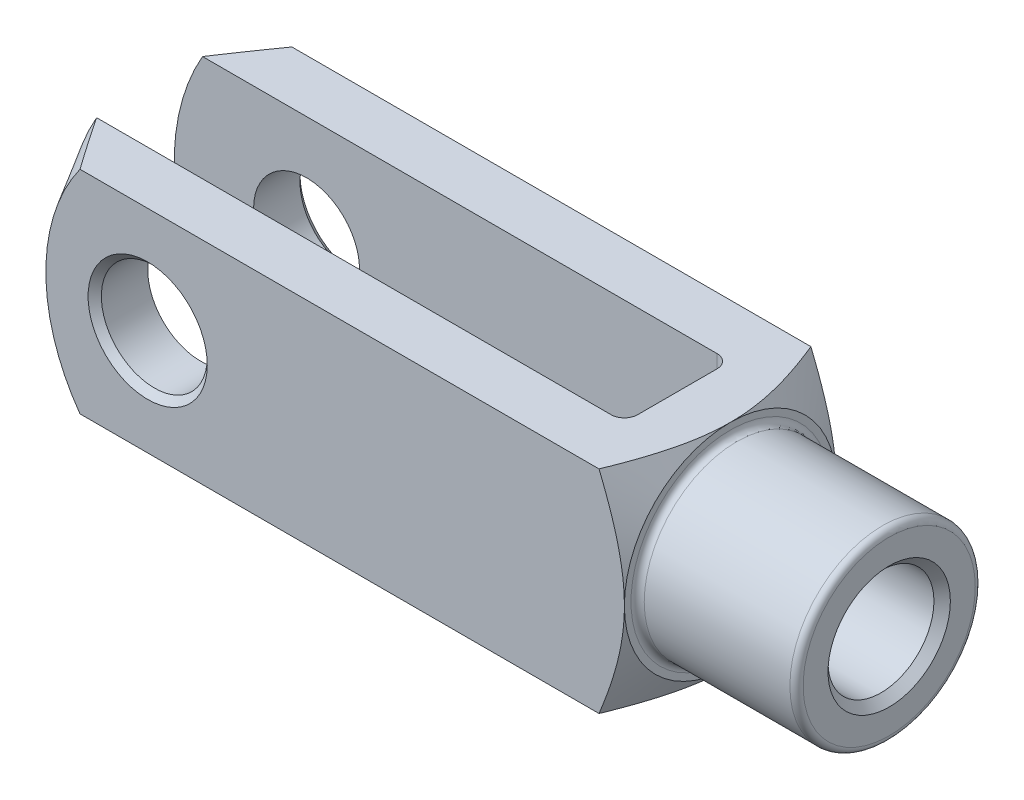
ISO-10303-21;
HEADER;
FILE_DESCRIPTION(('STEP AP214'),'2;1');
FILE_NAME('part.step','',(''),(''),'','','');
FILE_SCHEMA(('AUTOMOTIVE_DESIGN { 1 0 10303 214 1 1 1 1 }'));
ENDSEC;
DATA;
#1=APPLICATION_CONTEXT('core data for automotive mechanical design processes');
#2=APPLICATION_PROTOCOL_DEFINITION('international standard','automotive_design',2000,#1);
#3=PRODUCT_CONTEXT('',#1,'mechanical');
#4=PRODUCT('Part','Part','',(#3));
#5=PRODUCT_RELATED_PRODUCT_CATEGORY('part','',(#4));
#6=PRODUCT_DEFINITION_FORMATION('','',#4);
#7=PRODUCT_DEFINITION_CONTEXT('part definition',#1,'design');
#8=PRODUCT_DEFINITION('design','',#6,#7);
#9=PRODUCT_DEFINITION_SHAPE('','',#8);
#10=(LENGTH_UNIT() NAMED_UNIT(*) SI_UNIT(.MILLI.,.METRE.));
#11=(NAMED_UNIT(*) PLANE_ANGLE_UNIT() SI_UNIT($,.RADIAN.));
#12=(NAMED_UNIT(*) SI_UNIT($,.STERADIAN.) SOLID_ANGLE_UNIT());
#13=UNCERTAINTY_MEASURE_WITH_UNIT(LENGTH_MEASURE(1.E-05),#10,'distance_accuracy_value','');
#14=(GEOMETRIC_REPRESENTATION_CONTEXT(3) GLOBAL_UNCERTAINTY_ASSIGNED_CONTEXT((#13)) GLOBAL_UNIT_ASSIGNED_CONTEXT((#10,
#11,#12)) REPRESENTATION_CONTEXT('',''));
#15=CARTESIAN_POINT('',(0.,0.,0.));
#16=DIRECTION('',(0.,0.,1.));
#17=DIRECTION('',(1.,0.,0.));
#18=AXIS2_PLACEMENT_3D('',#15,#16,#17);
#19=CARTESIAN_POINT('',(-17.,-8.,-2.99999999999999));
#20=DIRECTION('',(0.,-1.,0.));
#21=DIRECTION('',(0.,0.,-1.));
#22=AXIS2_PLACEMENT_3D('',#19,#20,#21);
#23=CYLINDRICAL_SURFACE('',#22,1.);
#24=DIRECTION('',(0.,1.,0.));
#25=VECTOR('',#24,1.);
#26=CARTESIAN_POINT('',(-16.,-8.,-2.99999999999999));
#27=LINE('',#26,#25);
#28=CARTESIAN_POINT('',(-16.,-2.6457513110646,-2.99999999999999));
#29=VERTEX_POINT('',#28);
#30=CARTESIAN_POINT('',(-16.,-8.,-2.99999999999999));
#31=VERTEX_POINT('',#30);
#32=EDGE_CURVE('E358',#29,#31,#27,.F.);
#33=ORIENTED_EDGE('',*,*,#32,.F.);
#34=CARTESIAN_POINT('',(-16.,-2.6457513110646,-2.99999999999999));
#35=CARTESIAN_POINT('',(-16.0000222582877,-2.59691643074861,-3.04308129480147));
#36=CARTESIAN_POINT('',(-16.0027813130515,-2.54706628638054,-3.08491225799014));
#37=CARTESIAN_POINT('',(-16.012996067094,-2.44577843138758,-3.16580783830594));
#38=CARTESIAN_POINT('',(-16.0204427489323,-2.39434394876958,-3.20487760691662));
#39=CARTESIAN_POINT('',(-16.0391856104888,-2.29056221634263,-3.27984708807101));
#40=CARTESIAN_POINT('',(-16.0504501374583,-2.23822572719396,-3.31576990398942));
#41=CARTESIAN_POINT('',(-16.0762500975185,-2.13245420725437,-3.38476417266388));
#42=CARTESIAN_POINT('',(-16.0907876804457,-2.07901847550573,-3.4178337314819));
#43=CARTESIAN_POINT('',(-16.1314716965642,-1.94128133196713,-3.49869690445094));
#44=CARTESIAN_POINT('',(-16.159576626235,-1.85634962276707,-3.54444475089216));
#45=CARTESIAN_POINT('',(-16.2208922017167,-1.68494910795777,-3.62906229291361));
#46=CARTESIAN_POINT('',(-16.2541046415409,-1.5984797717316,-3.66792956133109));
#47=CARTESIAN_POINT('',(-16.3598954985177,-1.33652816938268,-3.77483346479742));
#48=CARTESIAN_POINT('',(-16.4383939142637,-1.1592254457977,-3.83275455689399));
#49=CARTESIAN_POINT('',(-16.5956023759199,-0.820227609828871,-3.91850936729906));
#50=CARTESIAN_POINT('',(-16.6735122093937,-0.658737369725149,-3.94876568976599));
#51=CARTESIAN_POINT('',(-16.8324153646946,-0.335223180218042,-3.98924683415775));
#52=CARTESIAN_POINT('',(-16.9133996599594,-0.173201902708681,-3.99952627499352));
#53=CARTESIAN_POINT('',(-16.9962288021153,-0.0075424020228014,-3.99999466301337));
#54=CARTESIAN_POINT('',(-16.9981144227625,-0.00377116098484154,-3.99999999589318));
#55=CARTESIAN_POINT('',(-17.,0.,-4.));
#56=B_SPLINE_CURVE_WITH_KNOTS('',3,(#34,#35,#36,#37,#38,#39,#40,#41,#42,#43,#44,#45,#46,#47,#48,
#49,#50,#51,#52,#53,#54,#55),.UNSPECIFIED.,.F.,.F.,(4,2,2,2,2,2,2,2,2,2,4),(0.,
0.195194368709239,0.390014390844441,0.583257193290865,0.776627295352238,1.07759313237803,
1.37866492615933,1.98338003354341,2.52784959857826,3.07082842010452,3.08347754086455),.UNSPECIFIED.);
#57=CARTESIAN_POINT('',(-17.,0.,-4.));
#58=VERTEX_POINT('',#57);
#59=EDGE_CURVE('E389',#29,#58,#56,.T.);
#60=ORIENTED_EDGE('',*,*,#59,.T.);
#61=DIRECTION('',(0.,1.,0.));
#62=VECTOR('',#61,1.);
#63=CARTESIAN_POINT('',(-17.,8.,-3.99999999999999));
#64=LINE('',#63,#62);
#65=CARTESIAN_POINT('',(-17.,-8.,-3.99999999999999));
#66=VERTEX_POINT('',#65);
#67=EDGE_CURVE('E182',#66,#58,#64,.T.);
#68=ORIENTED_EDGE('',*,*,#67,.F.);
#69=CARTESIAN_POINT('',(-17.,-8.,-2.99999999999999));
#70=DIRECTION('',(0.,-1.,0.));
#71=DIRECTION('',(0.,0.,-1.));
#72=AXIS2_PLACEMENT_3D('',#69,#70,#71);
#73=CIRCLE('',#72,1.);
#74=EDGE_CURVE('E197',#31,#66,#73,.F.);
#75=ORIENTED_EDGE('',*,*,#74,.F.);
#76=EDGE_LOOP('',(#33,#60,#68,#75));
#77=FACE_BOUND('',#76,.T.);
#78=ADVANCED_FACE('F37',(#77),#23,.F.);
#79=CARTESIAN_POINT('',(-16.,-8.,-3.99999999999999));
#80=DIRECTION('',(1.,0.,0.));
#81=DIRECTION('',(0.,0.,-1.));
#82=AXIS2_PLACEMENT_3D('',#79,#80,#81);
#83=PLANE('',#82);
#84=CARTESIAN_POINT('',(-16.,8.,-2.99999999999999));
#85=VERTEX_POINT('',#84);
#86=CARTESIAN_POINT('',(-16.,2.6457513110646,-2.99999999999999));
#87=VERTEX_POINT('',#86);
#88=EDGE_CURVE('E374',#85,#87,#27,.F.);
#89=ORIENTED_EDGE('',*,*,#88,.T.);
#90=CARTESIAN_POINT('',(-16.,0.,0.));
#91=DIRECTION('',(1.,0.,0.));
#92=DIRECTION('',(0.,0.,-1.));
#93=AXIS2_PLACEMENT_3D('',#90,#91,#92);
#94=CIRCLE('',#93,4.);
#95=CARTESIAN_POINT('',(-16.,2.6457513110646,2.99999999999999));
#96=VERTEX_POINT('',#95);
#97=EDGE_CURVE('E423',#87,#96,#94,.T.);
#98=ORIENTED_EDGE('',*,*,#97,.T.);
#99=DIRECTION('',(0.,1.,0.));
#100=VECTOR('',#99,1.);
#101=CARTESIAN_POINT('',(-16.,8.,2.99999999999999));
#102=LINE('',#101,#100);
#103=CARTESIAN_POINT('',(-16.,8.,2.99999999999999));
#104=VERTEX_POINT('',#103);
#105=EDGE_CURVE('E160',#96,#104,#102,.T.);
#106=ORIENTED_EDGE('',*,*,#105,.T.);
#107=DIRECTION('',(0.,0.,-1.));
#108=VECTOR('',#107,1.);
#109=CARTESIAN_POINT('',(-16.,8.,-3.99999999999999));
#110=LINE('',#109,#108);
#111=EDGE_CURVE('E338',#104,#85,#110,.T.);
#112=ORIENTED_EDGE('',*,*,#111,.T.);
#113=EDGE_LOOP('',(#89,#98,#106,#112));
#114=FACE_BOUND('',#113,.T.);
#115=ADVANCED_FACE('F473',(#114),#83,.F.);
#116=CARTESIAN_POINT('',(-17.,-8.,2.99999999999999));
#117=DIRECTION('',(0.,-1.,0.));
#118=DIRECTION('',(0.,0.,-1.));
#119=AXIS2_PLACEMENT_3D('',#116,#117,#118);
#120=CYLINDRICAL_SURFACE('',#119,1.);
#121=ORIENTED_EDGE('',*,*,#105,.F.);
#122=CARTESIAN_POINT('',(-16.,2.6457513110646,2.99999999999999));
#123=CARTESIAN_POINT('',(-16.0000222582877,2.59691643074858,3.0430812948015));
#124=CARTESIAN_POINT('',(-16.0027813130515,2.54706628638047,3.0849122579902));
#125=CARTESIAN_POINT('',(-16.012996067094,2.44577843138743,3.16580783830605));
#126=CARTESIAN_POINT('',(-16.0204427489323,2.39434394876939,3.20487760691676));
#127=CARTESIAN_POINT('',(-16.0391856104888,2.29056221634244,3.27984708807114));
#128=CARTESIAN_POINT('',(-16.0504501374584,2.23822572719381,3.31576990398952));
#129=CARTESIAN_POINT('',(-16.0762500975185,2.13245420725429,3.38476417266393));
#130=CARTESIAN_POINT('',(-16.0907876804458,2.07901847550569,3.41783373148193));
#131=CARTESIAN_POINT('',(-16.1314716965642,1.94128133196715,3.49869690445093));
#132=CARTESIAN_POINT('',(-16.159576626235,1.85634962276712,3.54444475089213));
#133=CARTESIAN_POINT('',(-16.2208922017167,1.68494910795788,3.62906229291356));
#134=CARTESIAN_POINT('',(-16.2541046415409,1.59847977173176,3.66792956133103));
#135=CARTESIAN_POINT('',(-16.3598954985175,1.33652816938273,3.77483346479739));
#136=CARTESIAN_POINT('',(-16.4383939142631,1.15922544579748,3.83275455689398));
#137=CARTESIAN_POINT('',(-16.5956023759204,0.820227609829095,3.91850936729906));
#138=CARTESIAN_POINT('',(-16.6735122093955,0.658737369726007,3.94876568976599));
#139=CARTESIAN_POINT('',(-16.8324153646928,0.335223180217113,3.98924683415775));
#140=CARTESIAN_POINT('',(-16.9133996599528,0.173201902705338,3.99952627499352));
#141=CARTESIAN_POINT('',(-16.996228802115,0.00754240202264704,3.99999466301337));
#142=CARTESIAN_POINT('',(-16.9981144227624,0.00377116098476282,3.99999999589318));
#143=CARTESIAN_POINT('',(-17.,0.,4.));
#144=B_SPLINE_CURVE_WITH_KNOTS('',3,(#122,#123,#124,#125,#126,#127,#128,#129,#130,#131,#132,
#133,#134,#135,#136,#137,#138,#139,#140,#141,#142,#143),.UNSPECIFIED.,.F.,.F.,(4,2,2,2,2,2,2,2,
2,2,4),(0.,0.195194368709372,0.390014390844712,0.583257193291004,0.776627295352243,
1.07759313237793,1.37866492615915,1.98338003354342,2.5278495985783,3.07082842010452,
3.08347754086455),.UNSPECIFIED.);
#145=CARTESIAN_POINT('',(-17.,0.,4.));
#146=VERTEX_POINT('',#145);
#147=EDGE_CURVE('E145',#96,#146,#144,.T.);
#148=ORIENTED_EDGE('',*,*,#147,.T.);
#149=DIRECTION('',(0.,1.,0.));
#150=VECTOR('',#149,1.);
#151=CARTESIAN_POINT('',(-17.,-8.,3.99999999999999));
#152=LINE('',#151,#150);
#153=CARTESIAN_POINT('',(-17.,8.,3.99999999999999));
#154=VERTEX_POINT('',#153);
#155=EDGE_CURVE('E159',#154,#146,#152,.F.);
#156=ORIENTED_EDGE('',*,*,#155,.F.);
#157=CARTESIAN_POINT('',(-17.,8.,2.99999999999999));
#158=DIRECTION('',(0.,1.,0.));
#159=DIRECTION('',(0.,0.,1.));
#160=AXIS2_PLACEMENT_3D('',#157,#158,#159);
#161=CIRCLE('',#160,1.);
#162=EDGE_CURVE('E189',#104,#154,#161,.F.);
#163=ORIENTED_EDGE('',*,*,#162,.F.);
#164=EDGE_LOOP('',(#121,#148,#156,#163));
#165=FACE_BOUND('',#164,.T.);
#166=ADVANCED_FACE('F156',(#165),#120,.F.);
#167=CARTESIAN_POINT('',(-58.,-8.,-4.));
#168=DIRECTION('',(0.,0.,-1.));
#169=DIRECTION('',(-1.,0.,0.));
#170=AXIS2_PLACEMENT_3D('',#167,#168,#169);
#171=PLANE('',#170);
#172=CARTESIAN_POINT('',(-48.,0.,-3.99999999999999));
#173=DIRECTION('',(0.,0.,-1.));
#174=DIRECTION('',(-1.,0.,0.));
#175=AXIS2_PLACEMENT_3D('',#172,#173,#174);
#176=CIRCLE('',#175,4.);
#177=CARTESIAN_POINT('',(-52.,0.,-4.));
#178=VERTEX_POINT('',#177);
#179=EDGE_CURVE('E368',#178,#178,#176,.F.);
#180=ORIENTED_EDGE('',*,*,#179,.F.);
#181=EDGE_LOOP('',(#180));
#182=FACE_BOUND('',#181,.T.);
#183=CARTESIAN_POINT('',(-42.,0.,-4.));
#184=DIRECTION('',(0.,0.,1.));
#185=DIRECTION('',(1.,0.,0.));
#186=AXIS2_PLACEMENT_3D('',#183,#184,#185);
#187=CIRCLE('',#186,16.);
#188=CARTESIAN_POINT('',(-55.856406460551,8.,-4.));
#189=VERTEX_POINT('',#188);
#190=CARTESIAN_POINT('',(-55.856406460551,-8.,-4.));
#191=VERTEX_POINT('',#190);
#192=EDGE_CURVE('E276',#189,#191,#187,.T.);
#193=ORIENTED_EDGE('',*,*,#192,.T.);
#194=DIRECTION('',(-1.,0.,0.));
#195=VECTOR('',#194,1.);
#196=CARTESIAN_POINT('',(-58.,-8.,-4.));
#197=LINE('',#196,#195);
#198=EDGE_CURVE('E333',#66,#191,#197,.T.);
#199=ORIENTED_EDGE('',*,*,#198,.F.);
#200=ORIENTED_EDGE('',*,*,#67,.T.);
#201=CARTESIAN_POINT('',(-17.,8.,-3.99999999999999));
#202=VERTEX_POINT('',#201);
#203=EDGE_CURVE('E179',#58,#202,#64,.T.);
#204=ORIENTED_EDGE('',*,*,#203,.T.);
#205=DIRECTION('',(-1.,0.,0.));
#206=VECTOR('',#205,1.);
#207=CARTESIAN_POINT('',(-58.,8.,-4.));
#208=LINE('',#207,#206);
#209=EDGE_CURVE('E346',#202,#189,#208,.T.);
#210=ORIENTED_EDGE('',*,*,#209,.T.);
#211=EDGE_LOOP('',(#193,#199,#200,#204,#210));
#212=FACE_BOUND('',#211,.T.);
#213=ADVANCED_FACE('F392',(#182,#212),#171,.F.);
#214=CARTESIAN_POINT('',(-58.,-8.,4.00000000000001));
#215=DIRECTION('',(0.,0.,1.));
#216=DIRECTION('',(1.,0.,0.));
#217=AXIS2_PLACEMENT_3D('',#214,#215,#216);
#218=PLANE('',#217);
#219=CARTESIAN_POINT('',(-48.,0.,4.00000000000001));
#220=DIRECTION('',(0.,0.,1.));
#221=DIRECTION('',(1.,0.,0.));
#222=AXIS2_PLACEMENT_3D('',#219,#220,#221);
#223=CIRCLE('',#222,4.);
#224=CARTESIAN_POINT('',(-44.,0.,4.00000000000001));
#225=VERTEX_POINT('',#224);
#226=EDGE_CURVE('E345',#225,#225,#223,.F.);
#227=ORIENTED_EDGE('',*,*,#226,.F.);
#228=EDGE_LOOP('',(#227));
#229=FACE_BOUND('',#228,.T.);
#230=DIRECTION('',(1.,0.,0.));
#231=VECTOR('',#230,1.);
#232=CARTESIAN_POINT('',(-58.,-8.,4.00000000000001));
#233=LINE('',#232,#231);
#234=CARTESIAN_POINT('',(-55.856406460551,-8.,4.00000000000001));
#235=VERTEX_POINT('',#234);
#236=CARTESIAN_POINT('',(-17.,-8.,3.99999999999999));
#237=VERTEX_POINT('',#236);
#238=EDGE_CURVE('E337',#235,#237,#233,.T.);
#239=ORIENTED_EDGE('',*,*,#238,.F.);
#240=CARTESIAN_POINT('',(-42.,0.,4.00000000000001));
#241=DIRECTION('',(0.,0.,1.));
#242=DIRECTION('',(1.,0.,0.));
#243=AXIS2_PLACEMENT_3D('',#240,#241,#242);
#244=CIRCLE('',#243,16.);
#245=CARTESIAN_POINT('',(-55.856406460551,8.,4.00000000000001));
#246=VERTEX_POINT('',#245);
#247=EDGE_CURVE('E415',#246,#235,#244,.T.);
#248=ORIENTED_EDGE('',*,*,#247,.F.);
#249=DIRECTION('',(1.,0.,0.));
#250=VECTOR('',#249,1.);
#251=CARTESIAN_POINT('',(-58.,8.,4.00000000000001));
#252=LINE('',#251,#250);
#253=EDGE_CURVE('E176',#246,#154,#252,.T.);
#254=ORIENTED_EDGE('',*,*,#253,.T.);
#255=ORIENTED_EDGE('',*,*,#155,.T.);
#256=EDGE_CURVE('E164',#146,#237,#152,.F.);
#257=ORIENTED_EDGE('',*,*,#256,.T.);
#258=EDGE_LOOP('',(#239,#248,#254,#255,#257));
#259=FACE_BOUND('',#258,.T.);
#260=ADVANCED_FACE('F173',(#229,#259),#218,.F.);
#261=CARTESIAN_POINT('',(-58.,-8.,8.));
#262=DIRECTION('',(0.,0.,1.));
#263=DIRECTION('',(1.,0.,0.));
#264=AXIS2_PLACEMENT_3D('',#261,#262,#263);
#265=PLANE('',#264);
#266=CARTESIAN_POINT('',(-48.,0.,8.));
#267=DIRECTION('',(0.,0.,1.));
#268=DIRECTION('',(1.,0.,0.));
#269=AXIS2_PLACEMENT_3D('',#266,#267,#268);
#270=CIRCLE('',#269,4.49999999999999);
#271=CARTESIAN_POINT('',(-43.5,0.,8.));
#272=VERTEX_POINT('',#271);
#273=EDGE_CURVE('E228',#272,#272,#270,.F.);
#274=ORIENTED_EDGE('',*,*,#273,.T.);
#275=EDGE_LOOP('',(#274));
#276=FACE_BOUND('',#275,.T.);
#277=DIRECTION('',(1.,0.,0.));
#278=VECTOR('',#277,1.);
#279=CARTESIAN_POINT('',(-58.,8.,8.));
#280=LINE('',#279,#278);
#281=CARTESIAN_POINT('',(-53.1100179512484,8.,8.));
#282=VERTEX_POINT('',#281);
#283=CARTESIAN_POINT('',(-13.9131704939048,8.,8.));
#284=VERTEX_POINT('',#283);
#285=EDGE_CURVE('E365',#282,#284,#280,.T.);
#286=ORIENTED_EDGE('',*,*,#285,.F.);
#287=CARTESIAN_POINT('',(-42.,0.,8.));
#288=DIRECTION('',(0.,0.,1.));
#289=DIRECTION('',(1.,0.,0.));
#290=AXIS2_PLACEMENT_3D('',#287,#288,#289);
#291=CIRCLE('',#290,13.6905989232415);
#292=CARTESIAN_POINT('',(-53.1100179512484,-8.,8.));
#293=VERTEX_POINT('',#292);
#294=EDGE_CURVE('E61',#282,#293,#291,.T.);
#295=ORIENTED_EDGE('',*,*,#294,.T.);
#296=DIRECTION('',(1.,0.,0.));
#297=VECTOR('',#296,1.);
#298=CARTESIAN_POINT('',(-58.,-8.,8.));
#299=LINE('',#298,#297);
#300=CARTESIAN_POINT('',(-13.9131704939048,-8.,8.));
#301=VERTEX_POINT('',#300);
#302=EDGE_CURVE('E362',#293,#301,#299,.T.);
#303=ORIENTED_EDGE('',*,*,#302,.T.);
#304=CARTESIAN_POINT('',(-17.8846987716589,-16.3392348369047,8.));
#305=CARTESIAN_POINT('',(-17.6802772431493,-15.9449469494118,8.));
#306=CARTESIAN_POINT('',(-17.4769364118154,-15.5500935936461,8.));
#307=CARTESIAN_POINT('',(-17.0729892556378,-14.7589649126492,8.));
#308=CARTESIAN_POINT('',(-16.8723830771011,-14.3626895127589,8.));
#309=CARTESIAN_POINT('',(-16.474153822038,-13.56777616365,8.));
#310=CARTESIAN_POINT('',(-16.2765365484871,-13.1691353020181,8.));
#311=CARTESIAN_POINT('',(-15.88546114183,-12.3698241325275,8.));
#312=CARTESIAN_POINT('',(-15.6920029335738,-11.9691538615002,8.));
#313=CARTESIAN_POINT('',(-15.2985635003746,-11.1406012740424,8.));
#314=CARTESIAN_POINT('',(-15.0989132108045,-10.7125613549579,8.));
#315=CARTESIAN_POINT('',(-14.7072115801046,-9.85297670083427,8.));
#316=CARTESIAN_POINT('',(-14.5151606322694,-9.42143178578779,8.));
#317=CARTESIAN_POINT('',(-14.1411578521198,-8.55419814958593,8.));
#318=CARTESIAN_POINT('',(-13.959201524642,-8.1185113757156,8.));
#319=CARTESIAN_POINT('',(-13.6086480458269,-7.24179288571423,8.));
#320=CARTESIAN_POINT('',(-13.4400493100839,-6.80076181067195,8.));
#321=CARTESIAN_POINT('',(-13.1834024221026,-6.08615976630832,8.));
#322=CARTESIAN_POINT('',(-13.0896630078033,-5.81463561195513,8.));
#323=CARTESIAN_POINT('',(-12.9102546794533,-5.2689424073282,8.));
#324=CARTESIAN_POINT('',(-12.8245850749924,-4.99477358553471,8.));
#325=CARTESIAN_POINT('',(-12.6629013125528,-4.44359021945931,8.));
#326=CARTESIAN_POINT('',(-12.5868869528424,-4.16657573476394,8.));
#327=CARTESIAN_POINT('',(-12.4463305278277,-3.60962774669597,8.));
#328=CARTESIAN_POINT('',(-12.3817883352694,-3.32969427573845,8.));
#329=CARTESIAN_POINT('',(-12.267479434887,-2.77364565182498,8.));
#330=CARTESIAN_POINT('',(-12.2174014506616,-2.49759512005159,8.));
#331=CARTESIAN_POINT('',(-12.1318063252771,-1.94322662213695,8.));
#332=CARTESIAN_POINT('',(-12.0962887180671,-1.66490872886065,8.));
#333=CARTESIAN_POINT('',(-12.0412989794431,-1.10685523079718,8.));
#334=CARTESIAN_POINT('',(-12.0218163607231,-0.82712067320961,8.));
#335=CARTESIAN_POINT('',(-11.9997560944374,-0.266983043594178,8.));
#336=CARTESIAN_POINT('',(-11.9971778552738,0.0134200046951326,8.));
#337=CARTESIAN_POINT('',(-12.0086102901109,0.553432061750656,8.));
#338=CARTESIAN_POINT('',(-12.0214258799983,0.813067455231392,8.));
#339=CARTESIAN_POINT('',(-12.0611642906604,1.33124486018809,8.));
#340=CARTESIAN_POINT('',(-12.0880870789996,1.5897868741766,8.));
#341=CARTESIAN_POINT('',(-12.155052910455,2.10528244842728,8.));
#342=CARTESIAN_POINT('',(-12.195102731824,2.36223511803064,8.));
#343=CARTESIAN_POINT('',(-12.2870021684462,2.87400792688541,8.));
#344=CARTESIAN_POINT('',(-12.3388521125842,3.12882800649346,8.));
#345=CARTESIAN_POINT('',(-12.4545600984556,3.6434629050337,8.));
#346=CARTESIAN_POINT('',(-12.518722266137,3.90320881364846,8.));
#347=CARTESIAN_POINT('',(-12.6564654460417,4.42017468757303,8.));
#348=CARTESIAN_POINT('',(-12.7300465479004,4.67739462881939,8.));
#349=CARTESIAN_POINT('',(-12.8852035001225,5.18938513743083,8.));
#350=CARTESIAN_POINT('',(-12.9667789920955,5.44415581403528,8.));
#351=CARTESIAN_POINT('',(-13.1366771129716,5.95141147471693,8.));
#352=CARTESIAN_POINT('',(-13.224999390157,6.20389657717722,8.));
#353=CARTESIAN_POINT('',(-13.4147611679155,6.7272922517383,8.));
#354=CARTESIAN_POINT('',(-13.5166830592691,6.99802735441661,8.));
#355=CARTESIAN_POINT('',(-13.7260618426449,7.53735530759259,8.));
#356=CARTESIAN_POINT('',(-13.8335190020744,7.80594805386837,8.));
#357=CARTESIAN_POINT('',(-14.0530704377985,8.34129271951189,8.));
#358=CARTESIAN_POINT('',(-14.1651656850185,8.60804423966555,8.));
#359=CARTESIAN_POINT('',(-14.3932328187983,9.13988748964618,8.));
#360=CARTESIAN_POINT('',(-14.5092047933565,9.40497918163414,8.));
#361=CARTESIAN_POINT('',(-14.8621889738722,10.1985259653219,8.));
#362=CARTESIAN_POINT('',(-15.1040848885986,10.7248088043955,8.));
#363=CARTESIAN_POINT('',(-15.5972155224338,11.7728810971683,8.));
#364=CARTESIAN_POINT('',(-15.8484492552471,12.2946710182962,8.));
#365=CARTESIAN_POINT('',(-16.3586491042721,13.3364224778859,8.));
#366=CARTESIAN_POINT('',(-16.6176364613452,13.8563735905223,8.));
#367=CARTESIAN_POINT('',(-17.1409123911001,14.8936090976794,8.));
#368=CARTESIAN_POINT('',(-17.4052010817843,15.4108934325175,8.));
#369=CARTESIAN_POINT('',(-17.9377393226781,16.4430931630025,8.));
#370=CARTESIAN_POINT('',(-18.2059868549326,16.9580096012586,8.));
#371=CARTESIAN_POINT('',(-18.7457004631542,17.9861456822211,8.));
#372=CARTESIAN_POINT('',(-19.0171665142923,18.4993653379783,8.));
#373=CARTESIAN_POINT('',(-19.754394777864,19.8847467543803,8.));
#374=CARTESIAN_POINT('',(-20.2225895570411,20.7556134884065,8.));
#375=CARTESIAN_POINT('',(-21.164259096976,22.494640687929,8.));
#376=CARTESIAN_POINT('',(-21.6377345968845,23.3628007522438,8.));
#377=CARTESIAN_POINT('',(-22.5857843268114,25.0920581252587,8.));
#378=CARTESIAN_POINT('',(-23.0603367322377,25.9531674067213,8.));
#379=CARTESIAN_POINT('',(-23.7742624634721,27.2435811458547,8.));
#380=CARTESIAN_POINT('',(-24.0125683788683,27.6734768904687,8.));
#381=CARTESIAN_POINT('',(-24.4898082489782,28.5329190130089,8.));
#382=CARTESIAN_POINT('',(-24.7287422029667,28.9624653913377,8.));
#383=CARTESIAN_POINT('',(-24.9679488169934,29.3918599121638,8.));
#384=B_SPLINE_CURVE_WITH_KNOTS('',3,(#304,#305,#306,#307,#308,#309,#310,#311,#312,#313,#314,
#315,#316,#317,#318,#319,#320,#321,#322,#323,#324,#325,#326,#327,#328,#329,#330,#331,#332,#333,
#334,#335,#336,#337,#338,#339,#340,#341,#342,#343,#344,#345,#346,#347,#348,#349,#350,#351,#352,
#353,#354,#355,#356,#357,#358,#359,#360,#361,#362,#363,#364,#365,#366,#367,#368,#369,#370,#371,
#372,#373,#374,#375,#376,#377,#378,#379,#380,#381,#382,#383),.UNSPECIFIED.,.F.,.F.,(4,2,2,2,2,2,
2,2,2,2,2,2,2,2,2,2,2,2,2,2,2,2,2,2,2,2,2,2,2,2,2,2,2,2,2,2,2,2,2,4),(0.,1.33239397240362,
2.66485895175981,3.99964423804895,5.33440538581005,6.7512847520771,8.16823735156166,
9.58455382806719,11.0007020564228,11.8623516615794,12.7239274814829,13.5854852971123,
14.4470335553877,15.2883577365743,16.1296549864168,16.9704015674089,17.8111187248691,
18.590575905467,19.3700312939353,20.1498897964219,20.9297700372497,21.732223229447,
22.5346840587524,23.3371089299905,24.139491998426,25.0072719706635,25.8750939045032,
26.7430984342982,27.6111226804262,29.3486130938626,31.085920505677,32.8285250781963,
34.5711684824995,36.3129523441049,38.0547227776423,41.0209268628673,43.9875514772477,
46.9371849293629,48.4117694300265,49.8863522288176),.UNSPECIFIED.);
#385=CARTESIAN_POINT('',(-12.,0.,8.));
#386=VERTEX_POINT('',#385);
#387=EDGE_CURVE('E305',#386,#301,#384,.F.);
#388=ORIENTED_EDGE('',*,*,#387,.F.);
#389=EDGE_CURVE('E303',#284,#386,#384,.F.);
#390=ORIENTED_EDGE('',*,*,#389,.F.);
#391=EDGE_LOOP('',(#286,#295,#303,#388,#390));
#392=FACE_BOUND('',#391,.T.);
#393=ADVANCED_FACE('F287',(#276,#392),#265,.T.);
#394=CARTESIAN_POINT('',(-58.,-8.,8.));
#395=DIRECTION('',(0.,-1.,0.));
#396=DIRECTION('',(0.,0.,-1.));
#397=AXIS2_PLACEMENT_3D('',#394,#395,#396);
#398=PLANE('',#397);
#399=ORIENTED_EDGE('',*,*,#198,.T.);
#400=CARTESIAN_POINT('',(-62.1857767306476,-8.,5.89565350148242));
#401=CARTESIAN_POINT('',(-61.7965292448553,-8.,5.2689297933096));
#402=CARTESIAN_POINT('',(-61.4062157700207,-8.,4.64286516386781));
#403=CARTESIAN_POINT('',(-60.6229580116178,-8.,3.39236663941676));
#404=CARTESIAN_POINT('',(-60.2300136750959,-8.,2.7679327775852));
#405=CARTESIAN_POINT('',(-59.4405400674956,-8.,1.52028939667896));
#406=CARTESIAN_POINT('',(-59.0440070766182,-8.,0.897082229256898));
#407=CARTESIAN_POINT('',(-58.2471530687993,-8.,-0.346899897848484));
#408=CARTESIAN_POINT('',(-57.8468320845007,-8.,-0.967674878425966));
#409=CARTESIAN_POINT('',(-57.0247666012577,-8.,-2.23198790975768));
#410=CARTESIAN_POINT('',(-56.6028241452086,-8.,-2.87539744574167));
#411=CARTESIAN_POINT('',(-55.7525673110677,-8.,-4.15798891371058));
#412=CARTESIAN_POINT('',(-55.3242529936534,-8.,-4.79717088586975));
#413=CARTESIAN_POINT('',(-54.459739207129,-8.,-6.06950936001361));
#414=CARTESIAN_POINT('',(-54.023545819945,-8.,-6.70266997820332));
#415=CARTESIAN_POINT('',(-53.3611233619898,-8.,-7.64668569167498));
#416=CARTESIAN_POINT('',(-53.1389647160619,-8.,-7.96039757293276));
#417=CARTESIAN_POINT('',(-52.6914753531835,-8.,-8.58554886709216));
#418=CARTESIAN_POINT('',(-52.4661446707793,-8.,-8.89698830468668));
#419=CARTESIAN_POINT('',(-52.01387775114,-8.,-9.51426261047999));
#420=CARTESIAN_POINT('',(-51.7869759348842,-8.,-9.82012266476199));
#421=CARTESIAN_POINT('',(-51.3288611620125,-8.,-10.4285917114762));
#422=CARTESIAN_POINT('',(-51.0976483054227,-8.,-10.7312007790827));
#423=CARTESIAN_POINT('',(-50.6297403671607,-8.,-11.332837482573));
#424=CARTESIAN_POINT('',(-50.3930380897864,-8.,-11.6318595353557));
#425=CARTESIAN_POINT('',(-49.9133962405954,-8.,-12.2248466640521));
#426=CARTESIAN_POINT('',(-49.6704570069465,-8.,-12.5188120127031));
#427=CARTESIAN_POINT('',(-49.1794855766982,-8.,-13.0972598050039));
#428=CARTESIAN_POINT('',(-48.9315323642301,-8.,-13.3818089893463));
#429=CARTESIAN_POINT('',(-48.4262856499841,-8.,-13.9426547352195));
#430=CARTESIAN_POINT('',(-48.1689897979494,-8.,-14.2189491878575));
#431=CARTESIAN_POINT('',(-47.6433260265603,-8.,-14.7597258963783));
#432=CARTESIAN_POINT('',(-47.3749843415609,-8.,-15.0242333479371));
#433=CARTESIAN_POINT('',(-46.9615433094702,-8.,-15.4091163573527));
#434=CARTESIAN_POINT('',(-46.8219428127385,-8.,-15.5354022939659));
#435=CARTESIAN_POINT('',(-46.5385996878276,-8.,-15.7832263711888));
#436=CARTESIAN_POINT('',(-46.394857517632,-8.,-15.9047650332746));
#437=CARTESIAN_POINT('',(-46.0975226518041,-8.,-16.1463249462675));
#438=CARTESIAN_POINT('',(-45.9437613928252,-8.,-16.2661397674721));
#439=CARTESIAN_POINT('',(-45.6305832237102,-8.,-16.4982387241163));
#440=CARTESIAN_POINT('',(-45.4711652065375,-8.,-16.6105213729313));
#441=CARTESIAN_POINT('',(-45.1461892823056,-8.,-16.825637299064));
#442=CARTESIAN_POINT('',(-44.9806363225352,-8.,-16.9284779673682));
#443=CARTESIAN_POINT('',(-44.6428904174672,-8.,-17.1224621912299));
#444=CARTESIAN_POINT('',(-44.4706992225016,-8.,-17.2136088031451));
#445=CARTESIAN_POINT('',(-44.0236575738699,-8.,-17.4270731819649));
#446=CARTESIAN_POINT('',(-43.7438013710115,-8.,-17.539468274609));
#447=CARTESIAN_POINT('',(-43.313444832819,-8.,-17.6730277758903));
#448=CARTESIAN_POINT('',(-43.1682897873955,-8.,-17.7117004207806));
#449=CARTESIAN_POINT('',(-42.8750748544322,-8.,-17.7760297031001));
#450=CARTESIAN_POINT('',(-42.7270150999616,-8.,-17.8016869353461));
#451=CARTESIAN_POINT('',(-42.427625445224,-8.,-17.8390585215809));
#452=CARTESIAN_POINT('',(-42.2762776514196,-8.,-17.8506309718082));
#453=CARTESIAN_POINT('',(-41.9731780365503,-8.,-17.8588139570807));
#454=CARTESIAN_POINT('',(-41.8214262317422,-8.,-17.855425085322));
#455=CARTESIAN_POINT('',(-41.518960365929,-8.,-17.8338479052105));
#456=CARTESIAN_POINT('',(-41.3682465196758,-8.,-17.8156566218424));
#457=CARTESIAN_POINT('',(-41.0691796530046,-8.,-17.765312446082));
#458=CARTESIAN_POINT('',(-40.9208270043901,-8.,-17.7331573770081));
#459=CARTESIAN_POINT('',(-40.6002883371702,-8.,-17.6490655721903));
#460=CARTESIAN_POINT('',(-40.4287768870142,-8.,-17.5945681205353));
#461=CARTESIAN_POINT('',(-40.0913326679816,-8.,-17.47036463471));
#462=CARTESIAN_POINT('',(-39.9254030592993,-8.,-17.400650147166));
#463=CARTESIAN_POINT('',(-39.5990125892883,-8.,-17.2483781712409));
#464=CARTESIAN_POINT('',(-39.4385691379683,-8.,-17.1657837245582));
#465=CARTESIAN_POINT('',(-39.12355142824,-8.,-16.9902060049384));
#466=CARTESIAN_POINT('',(-38.9689765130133,-8.,-16.897223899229));
#467=CARTESIAN_POINT('',(-38.6154702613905,-8.,-16.6708821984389));
#468=CARTESIAN_POINT('',(-38.4186208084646,-8.,-16.534282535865));
#469=CARTESIAN_POINT('',(-38.0333734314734,-8.,-16.2495879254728));
#470=CARTESIAN_POINT('',(-37.844979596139,-8.,-16.1014875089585));
#471=CARTESIAN_POINT('',(-37.4752188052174,-8.,-15.7961052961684));
#472=CARTESIAN_POINT('',(-37.2938660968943,-8.,-15.638806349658));
#473=CARTESIAN_POINT('',(-36.9375595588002,-8.,-15.3172162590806));
#474=CARTESIAN_POINT('',(-36.7626046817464,-8.,-15.1529262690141));
#475=CARTESIAN_POINT('',(-36.4170062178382,-8.,-14.8176183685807));
#476=CARTESIAN_POINT('',(-36.246399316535,-8.,-14.6465627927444));
#477=CARTESIAN_POINT('',(-35.9099413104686,-8.,-14.2998402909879));
#478=CARTESIAN_POINT('',(-35.7440903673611,-8.,-14.1241732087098));
#479=CARTESIAN_POINT('',(-35.4166747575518,-8.,-13.769243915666));
#480=CARTESIAN_POINT('',(-35.255105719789,-8.,-13.5899857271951));
#481=CARTESIAN_POINT('',(-34.9355274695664,-8.,-13.2283206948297));
#482=CARTESIAN_POINT('',(-34.7775183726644,-8.,-13.0459137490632));
#483=CARTESIAN_POINT('',(-34.3998299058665,-8.,-12.6023889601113));
#484=CARTESIAN_POINT('',(-34.1817025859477,-8.,-12.3399501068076));
#485=CARTESIAN_POINT('',(-33.7505813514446,-8.,-11.8108173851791));
#486=CARTESIAN_POINT('',(-33.5375884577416,-8.,-11.5441226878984));
#487=CARTESIAN_POINT('',(-33.1191841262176,-8.,-11.0114334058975));
#488=CARTESIAN_POINT('',(-32.9137065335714,-8.,-10.7454906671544));
#489=CARTESIAN_POINT('',(-32.506432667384,-8.,-10.2109265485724));
#490=CARTESIAN_POINT('',(-32.3046352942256,-8.,-9.9423060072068));
#491=CARTESIAN_POINT('',(-32.1043464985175,-8.,-9.67257983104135));
#492=B_SPLINE_CURVE_WITH_KNOTS('',3,(#400,#401,#402,#403,#404,#405,#406,#407,#408,#409,#410,
#411,#412,#413,#414,#415,#416,#417,#418,#419,#420,#421,#422,#423,#424,#425,#426,#427,#428,#429,
#430,#431,#432,#433,#434,#435,#436,#437,#438,#439,#440,#441,#442,#443,#444,#445,#446,#447,#448,
#449,#450,#451,#452,#453,#454,#455,#456,#457,#458,#459,#460,#461,#462,#463,#464,#465,#466,#467,
#468,#469,#470,#471,#472,#473,#474,#475,#476,#477,#478,#479,#480,#481,#482,#483,#484,#485,#486,
#487,#488,#489,#490,#491),.UNSPECIFIED.,.F.,.F.,(4,2,2,2,2,2,2,2,2,2,2,2,2,2,2,2,2,2,2,2,2,2,2,
2,2,2,2,2,2,2,2,2,2,2,2,2,2,2,2,2,2,2,2,2,2,4),(0.,2.21329571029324,4.42663610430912,
6.64261887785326,8.85858257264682,11.1668200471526,13.4750355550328,15.7815396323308,
16.9347484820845,18.0879447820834,19.2304162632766,20.3728612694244,21.5168995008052,
22.6608758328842,23.7929840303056,24.9253790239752,26.0552243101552,26.6198776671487,
27.1844688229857,27.76906913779,28.3537844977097,28.9380381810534,29.5221388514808,
30.4231831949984,30.8733513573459,31.3234989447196,31.7781451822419,32.2327733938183,
32.6874929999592,33.1422835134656,33.6813034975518,34.2206236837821,34.7615209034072,
35.3023574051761,36.0205977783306,36.7391817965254,37.4591511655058,38.1790021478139,
38.9036703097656,39.6283630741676,40.3522850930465,41.0762305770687,42.0999043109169,
43.1237799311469,44.1319728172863,45.1398593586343),.UNSPECIFIED.);
#493=CARTESIAN_POINT('',(-53.1100179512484,-8.,-8.));
#494=VERTEX_POINT('',#493);
#495=EDGE_CURVE('E275',#191,#494,#492,.T.);
#496=ORIENTED_EDGE('',*,*,#495,.T.);
#497=DIRECTION('',(1.,0.,0.));
#498=VECTOR('',#497,1.);
#499=CARTESIAN_POINT('',(-58.,-8.,-8.));
#500=LINE('',#499,#498);
#501=CARTESIAN_POINT('',(-13.9131704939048,-8.,-8.));
#502=VERTEX_POINT('',#501);
#503=EDGE_CURVE('E359',#494,#502,#500,.T.);
#504=ORIENTED_EDGE('',*,*,#503,.T.);
#505=CARTESIAN_POINT('',(-17.8846987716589,-8.,-16.3392348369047));
#506=CARTESIAN_POINT('',(-17.6802772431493,-8.,-15.9449469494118));
#507=CARTESIAN_POINT('',(-17.4769364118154,-8.,-15.5500935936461));
#508=CARTESIAN_POINT('',(-17.0729892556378,-8.,-14.7589649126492));
#509=CARTESIAN_POINT('',(-16.8723830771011,-8.,-14.3626895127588));
#510=CARTESIAN_POINT('',(-16.474153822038,-8.,-13.56777616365));
#511=CARTESIAN_POINT('',(-16.2765365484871,-8.,-13.1691353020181));
#512=CARTESIAN_POINT('',(-15.88546114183,-8.,-12.3698241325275));
#513=CARTESIAN_POINT('',(-15.6920029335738,-8.,-11.9691538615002));
#514=CARTESIAN_POINT('',(-15.2985635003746,-8.,-11.1406012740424));
#515=CARTESIAN_POINT('',(-15.0989132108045,-8.,-10.7125613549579));
#516=CARTESIAN_POINT('',(-14.7072115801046,-8.,-9.85297670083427));
#517=CARTESIAN_POINT('',(-14.5151606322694,-8.,-9.42143178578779));
#518=CARTESIAN_POINT('',(-14.1411578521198,-8.,-8.55419814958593));
#519=CARTESIAN_POINT('',(-13.959201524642,-8.,-8.1185113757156));
#520=CARTESIAN_POINT('',(-13.6086480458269,-8.,-7.24179288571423));
#521=CARTESIAN_POINT('',(-13.4400493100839,-8.,-6.80076181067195));
#522=CARTESIAN_POINT('',(-13.1834024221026,-8.,-6.08615976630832));
#523=CARTESIAN_POINT('',(-13.0896630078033,-8.,-5.81463561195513));
#524=CARTESIAN_POINT('',(-12.9102546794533,-8.,-5.2689424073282));
#525=CARTESIAN_POINT('',(-12.8245850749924,-8.,-4.99477358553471));
#526=CARTESIAN_POINT('',(-12.6629013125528,-8.,-4.44359021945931));
#527=CARTESIAN_POINT('',(-12.5868869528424,-8.,-4.16657573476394));
#528=CARTESIAN_POINT('',(-12.4463305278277,-8.,-3.60962774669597));
#529=CARTESIAN_POINT('',(-12.3817883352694,-8.,-3.32969427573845));
#530=CARTESIAN_POINT('',(-12.267479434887,-8.,-2.77364565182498));
#531=CARTESIAN_POINT('',(-12.2174014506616,-8.,-2.49759512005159));
#532=CARTESIAN_POINT('',(-12.1318063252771,-8.,-1.94322662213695));
#533=CARTESIAN_POINT('',(-12.0962887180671,-8.,-1.66490872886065));
#534=CARTESIAN_POINT('',(-12.0412989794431,-8.,-1.10685523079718));
#535=CARTESIAN_POINT('',(-12.0218163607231,-8.,-0.82712067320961));
#536=CARTESIAN_POINT('',(-11.9997560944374,-8.,-0.266983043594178));
#537=CARTESIAN_POINT('',(-11.9971778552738,-8.,0.013420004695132));
#538=CARTESIAN_POINT('',(-12.0086102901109,-8.,0.553432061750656));
#539=CARTESIAN_POINT('',(-12.0214258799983,-8.,0.813067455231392));
#540=CARTESIAN_POINT('',(-12.0611642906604,-8.,1.3312448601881));
#541=CARTESIAN_POINT('',(-12.0880870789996,-8.,1.5897868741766));
#542=CARTESIAN_POINT('',(-12.155052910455,-8.,2.10528244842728));
#543=CARTESIAN_POINT('',(-12.195102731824,-8.,2.36223511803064));
#544=CARTESIAN_POINT('',(-12.2870021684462,-8.,2.8740079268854));
#545=CARTESIAN_POINT('',(-12.3388521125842,-8.,3.12882800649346));
#546=CARTESIAN_POINT('',(-12.4545600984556,-8.,3.6434629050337));
#547=CARTESIAN_POINT('',(-12.518722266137,-8.,3.90320881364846));
#548=CARTESIAN_POINT('',(-12.6564654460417,-8.,4.42017468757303));
#549=CARTESIAN_POINT('',(-12.7300465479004,-8.,4.67739462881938));
#550=CARTESIAN_POINT('',(-12.8852035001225,-8.,5.18938513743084));
#551=CARTESIAN_POINT('',(-12.9667789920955,-8.,5.44415581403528));
#552=CARTESIAN_POINT('',(-13.1366771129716,-8.,5.95141147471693));
#553=CARTESIAN_POINT('',(-13.224999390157,-8.,6.20389657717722));
#554=CARTESIAN_POINT('',(-13.4147611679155,-8.,6.72729225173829));
#555=CARTESIAN_POINT('',(-13.5166830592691,-8.,6.99802735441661));
#556=CARTESIAN_POINT('',(-13.7260618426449,-8.,7.53735530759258));
#557=CARTESIAN_POINT('',(-13.8335190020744,-8.,7.80594805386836));
#558=CARTESIAN_POINT('',(-14.0530704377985,-8.,8.34129271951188));
#559=CARTESIAN_POINT('',(-14.1651656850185,-8.,8.60804423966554));
#560=CARTESIAN_POINT('',(-14.3932328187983,-8.,9.13988748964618));
#561=CARTESIAN_POINT('',(-14.5092047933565,-8.,9.40497918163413));
#562=CARTESIAN_POINT('',(-14.8621889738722,-8.,10.1985259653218));
#563=CARTESIAN_POINT('',(-15.1040848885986,-8.,10.7248088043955));
#564=CARTESIAN_POINT('',(-15.5972155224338,-8.,11.7728810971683));
#565=CARTESIAN_POINT('',(-15.8484492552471,-8.,12.2946710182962));
#566=CARTESIAN_POINT('',(-16.3586491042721,-8.,13.3364224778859));
#567=CARTESIAN_POINT('',(-16.6176364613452,-8.,13.8563735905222));
#568=CARTESIAN_POINT('',(-17.1409123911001,-8.,14.8936090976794));
#569=CARTESIAN_POINT('',(-17.4052010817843,-8.,15.4108934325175));
#570=CARTESIAN_POINT('',(-17.9377393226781,-8.,16.4430931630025));
#571=CARTESIAN_POINT('',(-18.2059868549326,-8.,16.9580096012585));
#572=CARTESIAN_POINT('',(-18.7457004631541,-8.,17.9861456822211));
#573=CARTESIAN_POINT('',(-19.0171665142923,-8.,18.4993653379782));
#574=CARTESIAN_POINT('',(-19.7543947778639,-8.,19.8847467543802));
#575=CARTESIAN_POINT('',(-20.2225895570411,-8.,20.7556134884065));
#576=CARTESIAN_POINT('',(-21.1642590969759,-8.,22.4946406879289));
#577=CARTESIAN_POINT('',(-21.6377345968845,-8.,23.3628007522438));
#578=CARTESIAN_POINT('',(-22.5857843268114,-8.,25.0920581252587));
#579=CARTESIAN_POINT('',(-23.0603367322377,-8.,25.9531674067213));
#580=CARTESIAN_POINT('',(-23.7742624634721,-8.,27.2435811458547));
#581=CARTESIAN_POINT('',(-24.0125683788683,-8.,27.6734768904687));
#582=CARTESIAN_POINT('',(-24.4898082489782,-8.,28.5329190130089));
#583=CARTESIAN_POINT('',(-24.7287422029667,-8.,28.9624653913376));
#584=CARTESIAN_POINT('',(-24.9679488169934,-8.,29.3918599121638));
#585=B_SPLINE_CURVE_WITH_KNOTS('',3,(#505,#506,#507,#508,#509,#510,#511,#512,#513,#514,#515,
#516,#517,#518,#519,#520,#521,#522,#523,#524,#525,#526,#527,#528,#529,#530,#531,#532,#533,#534,
#535,#536,#537,#538,#539,#540,#541,#542,#543,#544,#545,#546,#547,#548,#549,#550,#551,#552,#553,
#554,#555,#556,#557,#558,#559,#560,#561,#562,#563,#564,#565,#566,#567,#568,#569,#570,#571,#572,
#573,#574,#575,#576,#577,#578,#579,#580,#581,#582,#583,#584),.UNSPECIFIED.,.F.,.F.,(4,2,2,2,2,2,
2,2,2,2,2,2,2,2,2,2,2,2,2,2,2,2,2,2,2,2,2,2,2,2,2,2,2,2,2,2,2,2,2,4),(0.,1.33239397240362,
2.66485895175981,3.99964423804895,5.33440538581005,6.7512847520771,8.16823735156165,
9.58455382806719,11.0007020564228,11.8623516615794,12.7239274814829,13.5854852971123,
14.4470335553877,15.2883577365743,16.1296549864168,16.9704015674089,17.8111187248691,
18.590575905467,19.3700312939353,20.1498897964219,20.9297700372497,21.732223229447,
22.5346840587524,23.3371089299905,24.139491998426,25.0072719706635,25.8750939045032,
26.7430984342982,27.6111226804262,29.3486130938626,31.085920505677,32.8285250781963,
34.5711684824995,36.3129523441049,38.0547227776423,41.0209268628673,43.9875514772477,
46.9371849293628,48.4117694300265,49.8863522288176),.UNSPECIFIED.);
#586=CARTESIAN_POINT('',(-12.,-8.,0.));
#587=VERTEX_POINT('',#586);
#588=EDGE_CURVE('E304',#587,#502,#585,.F.);
#589=ORIENTED_EDGE('',*,*,#588,.F.);
#590=EDGE_CURVE('E295',#301,#587,#585,.F.);
#591=ORIENTED_EDGE('',*,*,#590,.F.);
#592=ORIENTED_EDGE('',*,*,#302,.F.);
#593=CARTESIAN_POINT('',(-32.1043464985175,-8.,9.67257983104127));
#594=CARTESIAN_POINT('',(-32.2670589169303,-8.,9.89172310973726));
#595=CARTESIAN_POINT('',(-32.4307769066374,-8.,10.1101254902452));
#596=CARTESIAN_POINT('',(-32.7605411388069,-8.,10.5451887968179));
#597=CARTESIAN_POINT('',(-32.9265875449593,-8.,10.7618495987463));
#598=CARTESIAN_POINT('',(-33.2615996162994,-8.,11.193521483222));
#599=CARTESIAN_POINT('',(-33.4305699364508,-8.,11.408528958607));
#600=CARTESIAN_POINT('',(-33.7715201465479,-8.,11.8361395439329));
#601=CARTESIAN_POINT('',(-33.943499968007,-8.,12.0487427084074));
#602=CARTESIAN_POINT('',(-34.2926381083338,-8.,12.4731812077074));
#603=CARTESIAN_POINT('',(-34.4698307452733,-8.,12.6849883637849));
#604=CARTESIAN_POINT('',(-34.8283156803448,-8.,13.1051024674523));
#605=CARTESIAN_POINT('',(-35.009607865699,-8.,13.3134095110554));
#606=CARTESIAN_POINT('',(-35.3768683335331,-8.,13.7256241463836));
#607=CARTESIAN_POINT('',(-35.5628334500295,-8.,13.9295345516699));
#608=CARTESIAN_POINT('',(-35.9403853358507,-8.,14.3320667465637));
#609=CARTESIAN_POINT('',(-36.1319715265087,-8.,14.5306890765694));
#610=CARTESIAN_POINT('',(-36.4910790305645,-8.,14.8904806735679));
#611=CARTESIAN_POINT('',(-36.6576300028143,-8.,15.0526161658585));
#612=CARTESIAN_POINT('',(-36.9962433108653,-8.,15.3710853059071));
#613=CARTESIAN_POINT('',(-37.1683061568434,-8.,15.5274184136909));
#614=CARTESIAN_POINT('',(-37.5189019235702,-8.,15.8328947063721));
#615=CARTESIAN_POINT('',(-37.6974384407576,-8.,15.9820337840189));
#616=CARTESIAN_POINT('',(-38.0618750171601,-8.,16.2710601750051));
#617=CARTESIAN_POINT('',(-38.2477741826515,-8.,16.410948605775));
#618=CARTESIAN_POINT('',(-38.6012192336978,-8.,16.6599597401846));
#619=CARTESIAN_POINT('',(-38.7676616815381,-8.,16.7706404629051));
#620=CARTESIAN_POINT('',(-39.1074374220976,-8.,16.9810366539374));
#621=CARTESIAN_POINT('',(-39.2807717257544,-8.,17.080750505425));
#622=CARTESIAN_POINT('',(-39.634164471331,-8.,17.266126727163));
#623=CARTESIAN_POINT('',(-39.8141997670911,-8.,17.3518327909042));
#624=CARTESIAN_POINT('',(-40.1813997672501,-8.,17.506229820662));
#625=CARTESIAN_POINT('',(-40.3685589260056,-8.,17.5749337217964));
#626=CARTESIAN_POINT('',(-40.6892302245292,-8.,17.6734067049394));
#627=CARTESIAN_POINT('',(-40.8210753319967,-8.,17.7086234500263));
#628=CARTESIAN_POINT('',(-41.0871179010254,-8.,17.7683536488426));
#629=CARTESIAN_POINT('',(-41.221313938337,-8.,17.7928733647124));
#630=CARTESIAN_POINT('',(-41.491267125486,-8.,17.830372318));
#631=CARTESIAN_POINT('',(-41.6270236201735,-8.,17.8433562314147));
#632=CARTESIAN_POINT('',(-41.8991612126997,-8.,17.857307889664));
#633=CARTESIAN_POINT('',(-42.0355423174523,-8.,17.8582755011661));
#634=CARTESIAN_POINT('',(-42.307915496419,-8.,17.8481532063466));
#635=CARTESIAN_POINT('',(-42.4439073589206,-8.,17.8370576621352));
#636=CARTESIAN_POINT('',(-42.7144209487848,-8.,17.8032271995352));
#637=CARTESIAN_POINT('',(-42.8489426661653,-8.,17.7804922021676));
#638=CARTESIAN_POINT('',(-43.1157304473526,-8.,17.7241769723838));
#639=CARTESIAN_POINT('',(-43.2479956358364,-8.,17.6905926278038));
#640=CARTESIAN_POINT('',(-43.5096572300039,-8.,17.6136188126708));
#641=CARTESIAN_POINT('',(-43.6390526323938,-8.,17.5702259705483));
#642=CARTESIAN_POINT('',(-43.9668256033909,-8.,17.4477922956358));
#643=CARTESIAN_POINT('',(-44.1628623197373,-8.,17.362464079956));
#644=CARTESIAN_POINT('',(-44.5466114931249,-8.,17.1748002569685));
#645=CARTESIAN_POINT('',(-44.7343181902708,-8.,17.0724531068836));
#646=CARTESIAN_POINT('',(-45.1024964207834,-8.,16.8539318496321));
#647=CARTESIAN_POINT('',(-45.2829346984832,-8.,16.7377021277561));
#648=CARTESIAN_POINT('',(-45.5480246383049,-8.,16.5554465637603));
#649=CARTESIAN_POINT('',(-45.6354476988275,-8.,16.4933858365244));
#650=CARTESIAN_POINT('',(-45.8085665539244,-8.,16.3668994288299));
#651=CARTESIAN_POINT('',(-45.8942623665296,-8.,16.3024737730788));
#652=CARTESIAN_POINT('',(-46.1509068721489,-8.,16.1045124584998));
#653=CARTESIAN_POINT('',(-46.3193520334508,-8.,15.9677243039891));
#654=CARTESIAN_POINT('',(-46.6504524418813,-8.,15.6872833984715));
#655=CARTESIAN_POINT('',(-46.8131062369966,-8.,15.543628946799));
#656=CARTESIAN_POINT('',(-47.1334782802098,-8.,15.2506679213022));
#657=CARTESIAN_POINT('',(-47.2911922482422,-8.,15.1013566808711));
#658=CARTESIAN_POINT('',(-47.6022002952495,-8.,14.7981897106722));
#659=CARTESIAN_POINT('',(-47.7554939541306,-8.,14.6443335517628));
#660=CARTESIAN_POINT('',(-48.2106452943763,-8.,14.1760951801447));
#661=CARTESIAN_POINT('',(-48.506685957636,-8.,13.8560564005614));
#662=CARTESIAN_POINT('',(-49.0866885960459,-8.,13.2055832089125));
#663=CARTESIAN_POINT('',(-49.3706558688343,-8.,12.8751534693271));
#664=CARTESIAN_POINT('',(-49.9327011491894,-8.,12.2023539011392));
#665=CARTESIAN_POINT('',(-50.2106622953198,-8.,11.8598867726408));
#666=CARTESIAN_POINT('',(-50.7589757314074,-8.,11.1688846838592));
#667=CARTESIAN_POINT('',(-51.0293272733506,-8.,10.8203491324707));
#668=CARTESIAN_POINT('',(-51.5632703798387,-8.,10.1193488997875));
#669=CARTESIAN_POINT('',(-51.8268753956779,-8.,9.76689443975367));
#670=CARTESIAN_POINT('',(-52.3490347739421,-8.,9.05825995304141));
#671=CARTESIAN_POINT('',(-52.6075890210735,-8.,8.70207984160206));
#672=CARTESIAN_POINT('',(-53.2858549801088,-8.,7.75611753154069));
#673=CARTESIAN_POINT('',(-53.7019973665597,-8.,7.16377742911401));
#674=CARTESIAN_POINT('',(-54.5257418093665,-8.,5.97318133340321));
#675=CARTESIAN_POINT('',(-54.9333435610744,-8.,5.37492513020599));
#676=CARTESIAN_POINT('',(-55.7422615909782,-8.,4.17339815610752));
#677=CARTESIAN_POINT('',(-56.1435718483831,-8.,3.57012333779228));
#678=CARTESIAN_POINT('',(-56.9409133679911,-8.,2.36009537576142));
#679=CARTESIAN_POINT('',(-57.3369445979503,-8.,1.75334221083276));
#680=CARTESIAN_POINT('',(-58.1085410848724,-8.,0.562091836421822));
#681=CARTESIAN_POINT('',(-58.4842781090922,-8.,-0.0222942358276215));
#682=CARTESIAN_POINT('',(-59.2325150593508,-8.,-1.19313827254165));
#683=CARTESIAN_POINT('',(-59.6050149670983,-8.,-1.77959624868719));
#684=CARTESIAN_POINT('',(-60.3468640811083,-8.,-2.95351044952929));
#685=CARTESIAN_POINT('',(-60.7162165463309,-8.,-3.54096461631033));
#686=CARTESIAN_POINT('',(-61.4526206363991,-8.,-4.71730170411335));
#687=CARTESIAN_POINT('',(-61.8196722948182,-8.,-5.30618460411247));
#688=CARTESIAN_POINT('',(-62.1857767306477,-8.,-5.89565350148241));
#689=B_SPLINE_CURVE_WITH_KNOTS('',3,(#593,#594,#595,#596,#597,#598,#599,#600,#601,#602,#603,
#604,#605,#606,#607,#608,#609,#610,#611,#612,#613,#614,#615,#616,#617,#618,#619,#620,#621,#622,
#623,#624,#625,#626,#627,#628,#629,#630,#631,#632,#633,#634,#635,#636,#637,#638,#639,#640,#641,
#642,#643,#644,#645,#646,#647,#648,#649,#650,#651,#652,#653,#654,#655,#656,#657,#658,#659,#660,
#661,#662,#663,#664,#665,#666,#667,#668,#669,#670,#671,#672,#673,#674,#675,#676,#677,#678,#679,
#680,#681,#682,#683,#684,#685,#686,#687,#688),.UNSPECIFIED.,.F.,.F.,(4,2,2,2,2,2,2,2,2,2,2,2,2,
2,2,2,2,2,2,2,2,2,2,2,2,2,2,2,2,2,2,2,2,2,2,2,2,2,2,2,2,2,2,2,2,2,2,4),(0.,0.818839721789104,
1.6377373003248,2.45808716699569,3.27841838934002,4.10682794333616,4.93521473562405,
5.76305465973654,6.59080965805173,7.28801039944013,7.98527586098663,8.68293480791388,
9.38050932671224,9.97982031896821,10.5792195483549,11.1767118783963,11.7737482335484,
12.1827648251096,12.5915416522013,13.000152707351,13.4087682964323,13.8175749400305,
14.2263843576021,14.6353489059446,15.0444542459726,15.6847545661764,16.3254909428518,
16.9688861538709,17.2904899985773,17.6120904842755,18.2628098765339,18.9136912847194,
19.5651218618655,20.2166141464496,21.5240521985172,22.8309105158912,24.1539912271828,
25.4772015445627,26.7975274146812,28.1178833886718,30.2894924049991,32.4611787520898,
34.6348300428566,36.8084946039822,38.8927489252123,40.9770150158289,43.058766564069,
45.1404876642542),.UNSPECIFIED.);
#690=EDGE_CURVE('E266',#293,#235,#689,.T.);
#691=ORIENTED_EDGE('',*,*,#690,.T.);
#692=ORIENTED_EDGE('',*,*,#238,.T.);
#693=CARTESIAN_POINT('',(-17.,-8.,2.99999999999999));
#694=DIRECTION('',(0.,-1.,0.));
#695=DIRECTION('',(0.,0.,-1.));
#696=AXIS2_PLACEMENT_3D('',#693,#694,#695);
#697=CIRCLE('',#696,1.);
#698=CARTESIAN_POINT('',(-16.,-8.,2.99999999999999));
#699=VERTEX_POINT('',#698);
#700=EDGE_CURVE('E166',#237,#699,#697,.F.);
#701=ORIENTED_EDGE('',*,*,#700,.T.);
#702=DIRECTION('',(0.,0.,-1.));
#703=VECTOR('',#702,1.);
#704=CARTESIAN_POINT('',(-16.,-8.,-3.99999999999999));
#705=LINE('',#704,#703);
#706=EDGE_CURVE('E341',#699,#31,#705,.T.);
#707=ORIENTED_EDGE('',*,*,#706,.T.);
#708=ORIENTED_EDGE('',*,*,#74,.T.);
#709=EDGE_LOOP('',(#399,#496,#504,#589,#591,#592,#691,#692,#701,#707,#708));
#710=FACE_BOUND('',#709,.T.);
#711=ADVANCED_FACE('F282',(#710),#398,.T.);
#712=CARTESIAN_POINT('',(-58.,-8.,-8.));
#713=DIRECTION('',(0.,0.,-1.));
#714=DIRECTION('',(-1.,0.,0.));
#715=AXIS2_PLACEMENT_3D('',#712,#713,#714);
#716=PLANE('',#715);
#717=CARTESIAN_POINT('',(-48.,0.,-8.));
#718=DIRECTION('',(0.,0.,-1.));
#719=DIRECTION('',(-1.,0.,0.));
#720=AXIS2_PLACEMENT_3D('',#717,#718,#719);
#721=CIRCLE('',#720,4.5);
#722=CARTESIAN_POINT('',(-52.5,0.,-8.));
#723=VERTEX_POINT('',#722);
#724=EDGE_CURVE('E216',#723,#723,#721,.F.);
#725=ORIENTED_EDGE('',*,*,#724,.T.);
#726=EDGE_LOOP('',(#725));
#727=FACE_BOUND('',#726,.T.);
#728=ORIENTED_EDGE('',*,*,#503,.F.);
#729=CARTESIAN_POINT('',(-42.,0.,-8.));
#730=DIRECTION('',(0.,0.,1.));
#731=DIRECTION('',(1.,0.,0.));
#732=AXIS2_PLACEMENT_3D('',#729,#730,#731);
#733=CIRCLE('',#732,13.6905989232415);
#734=CARTESIAN_POINT('',(-53.1100179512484,8.,-8.));
#735=VERTEX_POINT('',#734);
#736=EDGE_CURVE('E405',#735,#494,#733,.T.);
#737=ORIENTED_EDGE('',*,*,#736,.F.);
#738=DIRECTION('',(1.,0.,0.));
#739=VECTOR('',#738,1.);
#740=CARTESIAN_POINT('',(-58.,8.,-8.));
#741=LINE('',#740,#739);
#742=CARTESIAN_POINT('',(-13.9131704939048,8.,-8.));
#743=VERTEX_POINT('',#742);
#744=EDGE_CURVE('E355',#735,#743,#741,.T.);
#745=ORIENTED_EDGE('',*,*,#744,.T.);
#746=CARTESIAN_POINT('',(-17.8846987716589,-16.3392348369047,-8.));
#747=CARTESIAN_POINT('',(-17.6802772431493,-15.9449469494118,-8.));
#748=CARTESIAN_POINT('',(-17.4769364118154,-15.5500935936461,-8.));
#749=CARTESIAN_POINT('',(-17.0729892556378,-14.7589649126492,-8.));
#750=CARTESIAN_POINT('',(-16.8723830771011,-14.3626895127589,-8.));
#751=CARTESIAN_POINT('',(-16.474153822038,-13.56777616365,-8.));
#752=CARTESIAN_POINT('',(-16.2765365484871,-13.1691353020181,-8.));
#753=CARTESIAN_POINT('',(-15.88546114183,-12.3698241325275,-8.));
#754=CARTESIAN_POINT('',(-15.6920029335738,-11.9691538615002,-8.));
#755=CARTESIAN_POINT('',(-15.2985635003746,-11.1406012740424,-8.));
#756=CARTESIAN_POINT('',(-15.0989132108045,-10.7125613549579,-8.));
#757=CARTESIAN_POINT('',(-14.7072115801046,-9.85297670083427,-8.));
#758=CARTESIAN_POINT('',(-14.5151606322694,-9.42143178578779,-8.));
#759=CARTESIAN_POINT('',(-14.1411578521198,-8.55419814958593,-8.));
#760=CARTESIAN_POINT('',(-13.959201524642,-8.1185113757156,-8.));
#761=CARTESIAN_POINT('',(-13.6086480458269,-7.24179288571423,-8.));
#762=CARTESIAN_POINT('',(-13.4400493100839,-6.80076181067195,-8.));
#763=CARTESIAN_POINT('',(-13.1834024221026,-6.08615976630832,-8.));
#764=CARTESIAN_POINT('',(-13.0896630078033,-5.81463561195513,-8.));
#765=CARTESIAN_POINT('',(-12.9102546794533,-5.2689424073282,-8.));
#766=CARTESIAN_POINT('',(-12.8245850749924,-4.99477358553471,-8.));
#767=CARTESIAN_POINT('',(-12.6629013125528,-4.44359021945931,-8.));
#768=CARTESIAN_POINT('',(-12.5868869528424,-4.16657573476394,-8.));
#769=CARTESIAN_POINT('',(-12.4463305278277,-3.60962774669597,-8.));
#770=CARTESIAN_POINT('',(-12.3817883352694,-3.32969427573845,-8.));
#771=CARTESIAN_POINT('',(-12.267479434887,-2.77364565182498,-8.));
#772=CARTESIAN_POINT('',(-12.2174014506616,-2.49759512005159,-8.));
#773=CARTESIAN_POINT('',(-12.1318063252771,-1.94322662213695,-8.));
#774=CARTESIAN_POINT('',(-12.0962887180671,-1.66490872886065,-8.));
#775=CARTESIAN_POINT('',(-12.0412989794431,-1.10685523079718,-8.));
#776=CARTESIAN_POINT('',(-12.0218163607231,-0.82712067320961,-8.));
#777=CARTESIAN_POINT('',(-11.9997560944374,-0.266983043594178,-8.));
#778=CARTESIAN_POINT('',(-11.9971778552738,0.0134200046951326,-8.));
#779=CARTESIAN_POINT('',(-12.0086102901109,0.553432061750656,-8.));
#780=CARTESIAN_POINT('',(-12.0214258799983,0.813067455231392,-8.));
#781=CARTESIAN_POINT('',(-12.0611642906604,1.33124486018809,-8.));
#782=CARTESIAN_POINT('',(-12.0880870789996,1.5897868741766,-8.));
#783=CARTESIAN_POINT('',(-12.155052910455,2.10528244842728,-8.));
#784=CARTESIAN_POINT('',(-12.195102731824,2.36223511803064,-8.));
#785=CARTESIAN_POINT('',(-12.2870021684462,2.87400792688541,-8.));
#786=CARTESIAN_POINT('',(-12.3388521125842,3.12882800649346,-8.));
#787=CARTESIAN_POINT('',(-12.4545600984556,3.6434629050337,-8.));
#788=CARTESIAN_POINT('',(-12.518722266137,3.90320881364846,-8.));
#789=CARTESIAN_POINT('',(-12.6564654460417,4.42017468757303,-8.));
#790=CARTESIAN_POINT('',(-12.7300465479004,4.67739462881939,-8.));
#791=CARTESIAN_POINT('',(-12.8852035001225,5.18938513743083,-8.));
#792=CARTESIAN_POINT('',(-12.9667789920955,5.44415581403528,-8.));
#793=CARTESIAN_POINT('',(-13.1366771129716,5.95141147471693,-8.));
#794=CARTESIAN_POINT('',(-13.224999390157,6.20389657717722,-8.));
#795=CARTESIAN_POINT('',(-13.4147611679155,6.7272922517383,-8.));
#796=CARTESIAN_POINT('',(-13.5166830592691,6.99802735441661,-8.));
#797=CARTESIAN_POINT('',(-13.7260618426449,7.53735530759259,-8.));
#798=CARTESIAN_POINT('',(-13.8335190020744,7.80594805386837,-8.));
#799=CARTESIAN_POINT('',(-14.0530704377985,8.34129271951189,-8.));
#800=CARTESIAN_POINT('',(-14.1651656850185,8.60804423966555,-8.));
#801=CARTESIAN_POINT('',(-14.3932328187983,9.13988748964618,-8.));
#802=CARTESIAN_POINT('',(-14.5092047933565,9.40497918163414,-8.));
#803=CARTESIAN_POINT('',(-14.8621889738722,10.1985259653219,-8.));
#804=CARTESIAN_POINT('',(-15.1040848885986,10.7248088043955,-8.));
#805=CARTESIAN_POINT('',(-15.5972155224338,11.7728810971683,-8.));
#806=CARTESIAN_POINT('',(-15.8484492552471,12.2946710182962,-8.));
#807=CARTESIAN_POINT('',(-16.3586491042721,13.3364224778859,-8.));
#808=CARTESIAN_POINT('',(-16.6176364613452,13.8563735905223,-8.));
#809=CARTESIAN_POINT('',(-17.1409123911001,14.8936090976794,-8.));
#810=CARTESIAN_POINT('',(-17.4052010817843,15.4108934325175,-8.));
#811=CARTESIAN_POINT('',(-17.9377393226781,16.4430931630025,-8.));
#812=CARTESIAN_POINT('',(-18.2059868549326,16.9580096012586,-8.));
#813=CARTESIAN_POINT('',(-18.7457004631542,17.9861456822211,-8.));
#814=CARTESIAN_POINT('',(-19.0171665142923,18.4993653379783,-8.));
#815=CARTESIAN_POINT('',(-19.754394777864,19.8847467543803,-8.));
#816=CARTESIAN_POINT('',(-20.2225895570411,20.7556134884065,-8.));
#817=CARTESIAN_POINT('',(-21.164259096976,22.494640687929,-8.));
#818=CARTESIAN_POINT('',(-21.6377345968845,23.3628007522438,-8.));
#819=CARTESIAN_POINT('',(-22.5857843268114,25.0920581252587,-8.));
#820=CARTESIAN_POINT('',(-23.0603367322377,25.9531674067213,-8.));
#821=CARTESIAN_POINT('',(-23.7742624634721,27.2435811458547,-8.));
#822=CARTESIAN_POINT('',(-24.0125683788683,27.6734768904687,-8.));
#823=CARTESIAN_POINT('',(-24.4898082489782,28.5329190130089,-8.));
#824=CARTESIAN_POINT('',(-24.7287422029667,28.9624653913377,-8.));
#825=CARTESIAN_POINT('',(-24.9679488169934,29.3918599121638,-8.));
#826=B_SPLINE_CURVE_WITH_KNOTS('',3,(#746,#747,#748,#749,#750,#751,#752,#753,#754,#755,#756,
#757,#758,#759,#760,#761,#762,#763,#764,#765,#766,#767,#768,#769,#770,#771,#772,#773,#774,#775,
#776,#777,#778,#779,#780,#781,#782,#783,#784,#785,#786,#787,#788,#789,#790,#791,#792,#793,#794,
#795,#796,#797,#798,#799,#800,#801,#802,#803,#804,#805,#806,#807,#808,#809,#810,#811,#812,#813,
#814,#815,#816,#817,#818,#819,#820,#821,#822,#823,#824,#825),.UNSPECIFIED.,.F.,.F.,(4,2,2,2,2,2,
2,2,2,2,2,2,2,2,2,2,2,2,2,2,2,2,2,2,2,2,2,2,2,2,2,2,2,2,2,2,2,2,2,4),(0.,1.33239397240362,
2.66485895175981,3.99964423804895,5.33440538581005,6.7512847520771,8.16823735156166,
9.58455382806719,11.0007020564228,11.8623516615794,12.7239274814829,13.5854852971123,
14.4470335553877,15.2883577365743,16.1296549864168,16.9704015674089,17.8111187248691,
18.590575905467,19.3700312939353,20.1498897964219,20.9297700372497,21.732223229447,
22.5346840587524,23.3371089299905,24.139491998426,25.0072719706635,25.8750939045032,
26.7430984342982,27.6111226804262,29.3486130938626,31.085920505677,32.8285250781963,
34.5711684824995,36.3129523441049,38.0547227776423,41.0209268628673,43.9875514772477,
46.9371849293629,48.4117694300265,49.8863522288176),.UNSPECIFIED.);
#827=CARTESIAN_POINT('',(-12.,0.,-8.));
#828=VERTEX_POINT('',#827);
#829=EDGE_CURVE('E325',#828,#743,#826,.T.);
#830=ORIENTED_EDGE('',*,*,#829,.F.);
#831=EDGE_CURVE('E332',#502,#828,#826,.T.);
#832=ORIENTED_EDGE('',*,*,#831,.F.);
#833=EDGE_LOOP('',(#728,#737,#745,#830,#832));
#834=FACE_BOUND('',#833,.T.);
#835=ADVANCED_FACE('F286',(#727,#834),#716,.T.);
#836=CARTESIAN_POINT('',(-58.,8.,8.));
#837=DIRECTION('',(0.,1.,0.));
#838=DIRECTION('',(0.,0.,1.));
#839=AXIS2_PLACEMENT_3D('',#836,#837,#838);
#840=PLANE('',#839);
#841=ORIENTED_EDGE('',*,*,#744,.F.);
#842=CARTESIAN_POINT('',(-32.1043464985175,8.,-9.67257983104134));
#843=CARTESIAN_POINT('',(-32.2670589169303,8.,-9.89172310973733));
#844=CARTESIAN_POINT('',(-32.4307769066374,8.,-10.1101254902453));
#845=CARTESIAN_POINT('',(-32.7605411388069,8.,-10.5451887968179));
#846=CARTESIAN_POINT('',(-32.9265875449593,8.,-10.7618495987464));
#847=CARTESIAN_POINT('',(-33.2615996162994,8.,-11.193521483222));
#848=CARTESIAN_POINT('',(-33.4305699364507,8.,-11.4085289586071));
#849=CARTESIAN_POINT('',(-33.7715201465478,8.,-11.8361395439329));
#850=CARTESIAN_POINT('',(-33.9434999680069,8.,-12.0487427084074));
#851=CARTESIAN_POINT('',(-34.2926381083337,8.,-12.4731812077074));
#852=CARTESIAN_POINT('',(-34.4698307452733,8.,-12.6849883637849));
#853=CARTESIAN_POINT('',(-34.8283156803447,8.,-13.1051024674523));
#854=CARTESIAN_POINT('',(-35.0096078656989,8.,-13.3134095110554));
#855=CARTESIAN_POINT('',(-35.376868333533,8.,-13.7256241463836));
#856=CARTESIAN_POINT('',(-35.5628334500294,8.,-13.9295345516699));
#857=CARTESIAN_POINT('',(-35.9403853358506,8.,-14.3320667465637));
#858=CARTESIAN_POINT('',(-36.1319715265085,8.,-14.5306890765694));
#859=CARTESIAN_POINT('',(-36.4910790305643,8.,-14.8904806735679));
#860=CARTESIAN_POINT('',(-36.6576300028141,8.,-15.0526161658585));
#861=CARTESIAN_POINT('',(-36.9962433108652,8.,-15.3710853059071));
#862=CARTESIAN_POINT('',(-37.1683061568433,8.,-15.527418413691));
#863=CARTESIAN_POINT('',(-37.5189019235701,8.,-15.8328947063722));
#864=CARTESIAN_POINT('',(-37.6974384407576,8.,-15.982033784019));
#865=CARTESIAN_POINT('',(-38.06187501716,8.,-16.2710601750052));
#866=CARTESIAN_POINT('',(-38.2477741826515,8.,-16.4109486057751));
#867=CARTESIAN_POINT('',(-38.6012192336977,8.,-16.6599597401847));
#868=CARTESIAN_POINT('',(-38.7676616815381,8.,-16.7706404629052));
#869=CARTESIAN_POINT('',(-39.1074374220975,8.,-16.9810366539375));
#870=CARTESIAN_POINT('',(-39.2807717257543,8.,-17.0807505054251));
#871=CARTESIAN_POINT('',(-39.6341644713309,8.,-17.2661267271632));
#872=CARTESIAN_POINT('',(-39.8141997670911,8.,-17.3518327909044));
#873=CARTESIAN_POINT('',(-40.18139976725,8.,-17.5062298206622));
#874=CARTESIAN_POINT('',(-40.3685589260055,8.,-17.5749337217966));
#875=CARTESIAN_POINT('',(-40.6892302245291,8.,-17.6734067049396));
#876=CARTESIAN_POINT('',(-40.8210753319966,8.,-17.7086234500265));
#877=CARTESIAN_POINT('',(-41.0871179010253,8.,-17.7683536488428));
#878=CARTESIAN_POINT('',(-41.2213139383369,8.,-17.7928733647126));
#879=CARTESIAN_POINT('',(-41.4912671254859,8.,-17.8303723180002));
#880=CARTESIAN_POINT('',(-41.6270236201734,8.,-17.8433562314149));
#881=CARTESIAN_POINT('',(-41.8991612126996,8.,-17.8573078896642));
#882=CARTESIAN_POINT('',(-42.0355423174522,8.,-17.8582755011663));
#883=CARTESIAN_POINT('',(-42.3079154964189,8.,-17.8481532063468));
#884=CARTESIAN_POINT('',(-42.4439073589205,8.,-17.8370576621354));
#885=CARTESIAN_POINT('',(-42.7144209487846,8.,-17.8032271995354));
#886=CARTESIAN_POINT('',(-42.8489426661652,8.,-17.7804922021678));
#887=CARTESIAN_POINT('',(-43.1157304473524,8.,-17.7241769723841));
#888=CARTESIAN_POINT('',(-43.2479956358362,8.,-17.690592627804));
#889=CARTESIAN_POINT('',(-43.5096572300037,8.,-17.613618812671));
#890=CARTESIAN_POINT('',(-43.6390526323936,8.,-17.5702259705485));
#891=CARTESIAN_POINT('',(-43.9668256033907,8.,-17.447792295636));
#892=CARTESIAN_POINT('',(-44.1628623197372,8.,-17.3624640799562));
#893=CARTESIAN_POINT('',(-44.5466114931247,8.,-17.1748002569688));
#894=CARTESIAN_POINT('',(-44.7343181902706,8.,-17.0724531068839));
#895=CARTESIAN_POINT('',(-45.1024964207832,8.,-16.8539318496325));
#896=CARTESIAN_POINT('',(-45.282934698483,8.,-16.7377021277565));
#897=CARTESIAN_POINT('',(-45.5480246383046,8.,-16.5554465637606));
#898=CARTESIAN_POINT('',(-45.6354476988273,8.,-16.4933858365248));
#899=CARTESIAN_POINT('',(-45.8085665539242,8.,-16.3668994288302));
#900=CARTESIAN_POINT('',(-45.8942623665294,8.,-16.3024737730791));
#901=CARTESIAN_POINT('',(-46.1509068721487,8.,-16.1045124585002));
#902=CARTESIAN_POINT('',(-46.3193520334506,8.,-15.9677243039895));
#903=CARTESIAN_POINT('',(-46.650452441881,8.,-15.6872833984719));
#904=CARTESIAN_POINT('',(-46.8131062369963,8.,-15.5436289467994));
#905=CARTESIAN_POINT('',(-47.1334782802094,8.,-15.2506679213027));
#906=CARTESIAN_POINT('',(-47.2911922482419,8.,-15.1013566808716));
#907=CARTESIAN_POINT('',(-47.6022002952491,8.,-14.7981897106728));
#908=CARTESIAN_POINT('',(-47.7554939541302,8.,-14.6443335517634));
#909=CARTESIAN_POINT('',(-48.2106452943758,8.,-14.1760951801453));
#910=CARTESIAN_POINT('',(-48.5066859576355,8.,-13.8560564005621));
#911=CARTESIAN_POINT('',(-49.0866885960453,8.,-13.2055832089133));
#912=CARTESIAN_POINT('',(-49.3706558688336,8.,-12.8751534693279));
#913=CARTESIAN_POINT('',(-49.9327011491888,8.,-12.2023539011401));
#914=CARTESIAN_POINT('',(-50.210662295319,8.,-11.8598867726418));
#915=CARTESIAN_POINT('',(-50.7589757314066,8.,-11.1688846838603));
#916=CARTESIAN_POINT('',(-51.0293272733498,8.,-10.8203491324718));
#917=CARTESIAN_POINT('',(-51.5632703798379,8.,-10.1193488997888));
#918=CARTESIAN_POINT('',(-51.826875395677,8.,-9.76689443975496));
#919=CARTESIAN_POINT('',(-52.3490347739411,8.,-9.0582599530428));
#920=CARTESIAN_POINT('',(-52.6075890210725,8.,-8.7020798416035));
#921=CARTESIAN_POINT('',(-53.2858549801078,8.,-7.75611753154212));
#922=CARTESIAN_POINT('',(-53.7019973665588,8.,-7.16377742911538));
#923=CARTESIAN_POINT('',(-54.5257418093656,8.,-5.97318133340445));
#924=CARTESIAN_POINT('',(-54.9333435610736,8.,-5.37492513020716));
#925=CARTESIAN_POINT('',(-55.7422615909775,8.,-4.17339815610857));
#926=CARTESIAN_POINT('',(-56.1435718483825,8.,-3.57012333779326));
#927=CARTESIAN_POINT('',(-56.9409133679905,8.,-2.36009537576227));
#928=CARTESIAN_POINT('',(-57.3369445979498,8.,-1.75334221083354));
#929=CARTESIAN_POINT('',(-58.1085410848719,8.,-0.562091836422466));
#930=CARTESIAN_POINT('',(-58.4842781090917,8.,0.0222942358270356));
#931=CARTESIAN_POINT('',(-59.2325150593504,8.,1.19313827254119));
#932=CARTESIAN_POINT('',(-59.605014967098,8.,1.77959624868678));
#933=CARTESIAN_POINT('',(-60.3468640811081,8.,2.95351044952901));
#934=CARTESIAN_POINT('',(-60.7162165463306,8.,3.5409646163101));
#935=CARTESIAN_POINT('',(-61.4526206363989,8.,4.71730170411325));
#936=CARTESIAN_POINT('',(-61.8196722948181,8.,5.30618460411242));
#937=CARTESIAN_POINT('',(-62.1857767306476,8.,5.89565350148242));
#938=B_SPLINE_CURVE_WITH_KNOTS('',3,(#842,#843,#844,#845,#846,#847,#848,#849,#850,#851,#852,
#853,#854,#855,#856,#857,#858,#859,#860,#861,#862,#863,#864,#865,#866,#867,#868,#869,#870,#871,
#872,#873,#874,#875,#876,#877,#878,#879,#880,#881,#882,#883,#884,#885,#886,#887,#888,#889,#890,
#891,#892,#893,#894,#895,#896,#897,#898,#899,#900,#901,#902,#903,#904,#905,#906,#907,#908,#909,
#910,#911,#912,#913,#914,#915,#916,#917,#918,#919,#920,#921,#922,#923,#924,#925,#926,#927,#928,
#929,#930,#931,#932,#933,#934,#935,#936,#937),.UNSPECIFIED.,.F.,.F.,(4,2,2,2,2,2,2,2,2,2,2,2,2,
2,2,2,2,2,2,2,2,2,2,2,2,2,2,2,2,2,2,2,2,2,2,2,2,2,2,2,2,2,2,2,2,2,2,4),(0.,0.818839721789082,
1.63773730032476,2.45808716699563,3.27841838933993,4.10682794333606,4.93521473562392,
5.76305465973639,6.59080965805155,7.28801039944,7.98527586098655,8.68293480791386,
9.38050932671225,9.97982031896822,10.5792195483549,11.1767118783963,11.7737482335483,
12.1827648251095,12.5915416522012,13.000152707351,13.4087682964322,13.8175749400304,
14.2263843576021,14.6353489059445,15.0444542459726,15.6847545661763,16.3254909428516,
16.9688861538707,17.2904899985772,17.6120904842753,18.2628098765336,18.913691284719,
19.5651218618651,20.2166141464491,21.5240521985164,22.8309105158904,24.1539912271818,
25.4772015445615,26.7975274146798,28.1178833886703,30.2894924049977,32.4611787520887,
34.6348300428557,36.8084946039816,38.8927489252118,40.9770150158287,43.058766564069,
45.1404876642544),.UNSPECIFIED.);
#939=EDGE_CURVE('E246',#735,#189,#938,.T.);
#940=ORIENTED_EDGE('',*,*,#939,.T.);
#941=ORIENTED_EDGE('',*,*,#209,.F.);
#942=CARTESIAN_POINT('',(-17.,8.,-2.99999999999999));
#943=DIRECTION('',(0.,1.,0.));
#944=DIRECTION('',(0.,0.,1.));
#945=AXIS2_PLACEMENT_3D('',#942,#943,#944);
#946=CIRCLE('',#945,1.);
#947=EDGE_CURVE('E194',#202,#85,#946,.F.);
#948=ORIENTED_EDGE('',*,*,#947,.T.);
#949=ORIENTED_EDGE('',*,*,#111,.F.);
#950=ORIENTED_EDGE('',*,*,#162,.T.);
#951=ORIENTED_EDGE('',*,*,#253,.F.);
#952=CARTESIAN_POINT('',(-62.1857767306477,8.,-5.89565350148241));
#953=CARTESIAN_POINT('',(-61.7965292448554,8.,-5.26892979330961));
#954=CARTESIAN_POINT('',(-61.4062157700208,8.,-4.64286516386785));
#955=CARTESIAN_POINT('',(-60.6229580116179,8.,-3.39236663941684));
#956=CARTESIAN_POINT('',(-60.2300136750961,8.,-2.7679327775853));
#957=CARTESIAN_POINT('',(-59.4405400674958,8.,-1.52028939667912));
#958=CARTESIAN_POINT('',(-59.0440070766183,8.,-0.897082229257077));
#959=CARTESIAN_POINT('',(-58.2471530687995,8.,0.346899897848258));
#960=CARTESIAN_POINT('',(-57.8468320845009,8.,0.96767487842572));
#961=CARTESIAN_POINT('',(-57.024766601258,8.,2.23198790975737));
#962=CARTESIAN_POINT('',(-56.6028241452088,8.,2.87539744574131));
#963=CARTESIAN_POINT('',(-55.752567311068,8.,4.15798891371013));
#964=CARTESIAN_POINT('',(-55.3242529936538,8.,4.79717088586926));
#965=CARTESIAN_POINT('',(-54.4597392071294,8.,6.06950936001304));
#966=CARTESIAN_POINT('',(-54.0235458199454,8.,6.70266997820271));
#967=CARTESIAN_POINT('',(-53.3611233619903,8.,7.64668569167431));
#968=CARTESIAN_POINT('',(-53.1389647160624,8.,7.96039757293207));
#969=CARTESIAN_POINT('',(-52.691475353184,8.,8.58554886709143));
#970=CARTESIAN_POINT('',(-52.4661446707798,8.,8.89698830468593));
#971=CARTESIAN_POINT('',(-52.0138777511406,8.,9.5142626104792));
#972=CARTESIAN_POINT('',(-51.7869759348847,8.,9.82012266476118));
#973=CARTESIAN_POINT('',(-51.3288611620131,8.,10.4285917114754));
#974=CARTESIAN_POINT('',(-51.0976483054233,8.,10.7312007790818));
#975=CARTESIAN_POINT('',(-50.6297403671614,8.,11.3328374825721));
#976=CARTESIAN_POINT('',(-50.3930380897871,8.,11.6318595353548));
#977=CARTESIAN_POINT('',(-49.913396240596,8.,12.2248466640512));
#978=CARTESIAN_POINT('',(-49.6704570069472,8.,12.5188120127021));
#979=CARTESIAN_POINT('',(-49.1794855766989,8.,13.0972598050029));
#980=CARTESIAN_POINT('',(-48.9315323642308,8.,13.3818089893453));
#981=CARTESIAN_POINT('',(-48.4262856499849,8.,13.9426547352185));
#982=CARTESIAN_POINT('',(-48.1689897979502,8.,14.2189491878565));
#983=CARTESIAN_POINT('',(-47.6433260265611,8.,14.7597258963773));
#984=CARTESIAN_POINT('',(-47.3749843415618,8.,15.0242333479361));
#985=CARTESIAN_POINT('',(-46.9615433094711,8.,15.4091163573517));
#986=CARTESIAN_POINT('',(-46.8219428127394,8.,15.5354022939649));
#987=CARTESIAN_POINT('',(-46.5385996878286,8.,15.7832263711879));
#988=CARTESIAN_POINT('',(-46.3948575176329,8.,15.9047650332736));
#989=CARTESIAN_POINT('',(-46.0975226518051,8.,16.1463249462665));
#990=CARTESIAN_POINT('',(-45.9437613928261,8.,16.2661397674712));
#991=CARTESIAN_POINT('',(-45.630583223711,8.,16.4982387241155));
#992=CARTESIAN_POINT('',(-45.4711652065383,8.,16.6105213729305));
#993=CARTESIAN_POINT('',(-45.1461892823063,8.,16.8256372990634));
#994=CARTESIAN_POINT('',(-44.9806363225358,8.,16.9284779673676));
#995=CARTESIAN_POINT('',(-44.6428904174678,8.,17.1224621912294));
#996=CARTESIAN_POINT('',(-44.4706992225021,8.,17.2136088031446));
#997=CARTESIAN_POINT('',(-44.0236575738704,8.,17.4270731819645));
#998=CARTESIAN_POINT('',(-43.743801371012,8.,17.5394682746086));
#999=CARTESIAN_POINT('',(-43.3134448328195,8.,17.67302777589));
#1000=CARTESIAN_POINT('',(-43.1682897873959,8.,17.7117004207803));
#1001=CARTESIAN_POINT('',(-42.8750748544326,8.,17.7760297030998));
#1002=CARTESIAN_POINT('',(-42.7270150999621,8.,17.8016869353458));
#1003=CARTESIAN_POINT('',(-42.4276254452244,8.,17.8390585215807));
#1004=CARTESIAN_POINT('',(-42.27627765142,8.,17.850630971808));
#1005=CARTESIAN_POINT('',(-41.9731780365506,8.,17.8588139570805));
#1006=CARTESIAN_POINT('',(-41.8214262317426,8.,17.8554250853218));
#1007=CARTESIAN_POINT('',(-41.5189603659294,8.,17.8338479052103));
#1008=CARTESIAN_POINT('',(-41.3682465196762,8.,17.8156566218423));
#1009=CARTESIAN_POINT('',(-41.0691796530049,8.,17.7653124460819));
#1010=CARTESIAN_POINT('',(-40.9208270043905,8.,17.733157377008));
#1011=CARTESIAN_POINT('',(-40.6002883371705,8.,17.6490655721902));
#1012=CARTESIAN_POINT('',(-40.4287768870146,8.,17.5945681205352));
#1013=CARTESIAN_POINT('',(-40.091332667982,8.,17.4703646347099));
#1014=CARTESIAN_POINT('',(-39.9254030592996,8.,17.4006501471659));
#1015=CARTESIAN_POINT('',(-39.5990125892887,8.,17.2483781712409));
#1016=CARTESIAN_POINT('',(-39.4385691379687,8.,17.1657837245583));
#1017=CARTESIAN_POINT('',(-39.1235514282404,8.,16.9902060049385));
#1018=CARTESIAN_POINT('',(-38.9689765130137,8.,16.897223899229));
#1019=CARTESIAN_POINT('',(-38.6154702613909,8.,16.6708821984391));
#1020=CARTESIAN_POINT('',(-38.4186208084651,8.,16.5342825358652));
#1021=CARTESIAN_POINT('',(-38.033373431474,8.,16.249587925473));
#1022=CARTESIAN_POINT('',(-37.8449795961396,8.,16.1014875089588));
#1023=CARTESIAN_POINT('',(-37.4752188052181,8.,15.7961052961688));
#1024=CARTESIAN_POINT('',(-37.293866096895,8.,15.6388063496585));
#1025=CARTESIAN_POINT('',(-36.937559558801,8.,15.3172162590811));
#1026=CARTESIAN_POINT('',(-36.7626046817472,8.,15.1529262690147));
#1027=CARTESIAN_POINT('',(-36.4170062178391,8.,14.8176183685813));
#1028=CARTESIAN_POINT('',(-36.2463993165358,8.,14.6465627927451));
#1029=CARTESIAN_POINT('',(-35.9099413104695,8.,14.2998402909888));
#1030=CARTESIAN_POINT('',(-35.7440903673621,8.,14.1241732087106));
#1031=CARTESIAN_POINT('',(-35.4166747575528,8.,13.769243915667));
#1032=CARTESIAN_POINT('',(-35.25510571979,8.,13.5899857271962));
#1033=CARTESIAN_POINT('',(-34.9355274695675,8.,13.2283206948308));
#1034=CARTESIAN_POINT('',(-34.7775183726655,8.,13.0459137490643));
#1035=CARTESIAN_POINT('',(-34.3998299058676,8.,12.6023889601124));
#1036=CARTESIAN_POINT('',(-34.1817025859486,8.,12.3399501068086));
#1037=CARTESIAN_POINT('',(-33.7505813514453,8.,11.8108173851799));
#1038=CARTESIAN_POINT('',(-33.5375884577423,8.,11.544122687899));
#1039=CARTESIAN_POINT('',(-33.119184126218,8.,11.011433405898));
#1040=CARTESIAN_POINT('',(-32.9137065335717,8.,10.7454906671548));
#1041=CARTESIAN_POINT('',(-32.5064326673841,8.,10.2109265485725));
#1042=CARTESIAN_POINT('',(-32.3046352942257,8.,9.94230600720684));
#1043=CARTESIAN_POINT('',(-32.1043464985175,8.,9.67257983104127));
#1044=B_SPLINE_CURVE_WITH_KNOTS('',3,(#952,#953,#954,#955,#956,#957,#958,#959,#960,#961,#962,
#963,#964,#965,#966,#967,#968,#969,#970,#971,#972,#973,#974,#975,#976,#977,#978,#979,#980,#981,
#982,#983,#984,#985,#986,#987,#988,#989,#990,#991,#992,#993,#994,#995,#996,#997,#998,#999,#1000,
#1001,#1002,#1003,#1004,#1005,#1006,#1007,#1008,#1009,#1010,#1011,#1012,#1013,#1014,#1015,#1016,
#1017,#1018,#1019,#1020,#1021,#1022,#1023,#1024,#1025,#1026,#1027,#1028,#1029,#1030,#1031,#1032,
#1033,#1034,#1035,#1036,#1037,#1038,#1039,#1040,#1041,#1042,#1043),.UNSPECIFIED.,.F.,.F.,(4,2,2,
2,2,2,2,2,2,2,2,2,2,2,2,2,2,2,2,2,2,2,2,2,2,2,2,2,2,2,2,2,2,2,2,2,2,2,2,2,2,2,2,2,2,4),(0.,
2.21329571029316,4.42663610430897,6.64261887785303,8.85858257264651,11.1668200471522,
13.4750355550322,15.7815396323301,16.9347484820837,18.0879447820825,19.2304162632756,
20.3728612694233,21.5168995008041,22.660875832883,23.7929840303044,24.925379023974,
26.0552243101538,26.6198776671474,27.1844688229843,27.7690691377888,28.3537844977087,
28.9380381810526,29.5221388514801,30.4231831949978,30.8733513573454,31.3234989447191,
31.7781451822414,32.2327733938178,32.6874929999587,33.1422835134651,33.6813034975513,
34.2206236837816,34.7615209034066,35.3023574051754,36.0205977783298,36.7391817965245,
37.4591511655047,38.1790021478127,38.9036703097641,39.628363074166,40.3522850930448,
41.0762305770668,42.0999043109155,43.1237799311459,44.1319728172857,45.1398593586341),.UNSPECIFIED.);
#1045=EDGE_CURVE('E238',#246,#282,#1044,.T.);
#1046=ORIENTED_EDGE('',*,*,#1045,.T.);
#1047=ORIENTED_EDGE('',*,*,#285,.T.);
#1048=CARTESIAN_POINT('',(-17.8846987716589,8.,-16.3392348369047));
#1049=CARTESIAN_POINT('',(-17.6802772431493,8.,-15.9449469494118));
#1050=CARTESIAN_POINT('',(-17.4769364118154,8.,-15.5500935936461));
#1051=CARTESIAN_POINT('',(-17.0729892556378,8.,-14.7589649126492));
#1052=CARTESIAN_POINT('',(-16.8723830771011,8.,-14.3626895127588));
#1053=CARTESIAN_POINT('',(-16.474153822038,8.,-13.56777616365));
#1054=CARTESIAN_POINT('',(-16.2765365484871,8.,-13.1691353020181));
#1055=CARTESIAN_POINT('',(-15.88546114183,8.,-12.3698241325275));
#1056=CARTESIAN_POINT('',(-15.6920029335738,8.,-11.9691538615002));
#1057=CARTESIAN_POINT('',(-15.2985635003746,8.,-11.1406012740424));
#1058=CARTESIAN_POINT('',(-15.0989132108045,8.,-10.7125613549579));
#1059=CARTESIAN_POINT('',(-14.7072115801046,8.,-9.85297670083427));
#1060=CARTESIAN_POINT('',(-14.5151606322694,8.,-9.42143178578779));
#1061=CARTESIAN_POINT('',(-14.1411578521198,8.,-8.55419814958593));
#1062=CARTESIAN_POINT('',(-13.959201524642,8.,-8.1185113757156));
#1063=CARTESIAN_POINT('',(-13.6086480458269,8.,-7.24179288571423));
#1064=CARTESIAN_POINT('',(-13.4400493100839,8.,-6.80076181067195));
#1065=CARTESIAN_POINT('',(-13.1834024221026,8.,-6.08615976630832));
#1066=CARTESIAN_POINT('',(-13.0896630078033,8.,-5.81463561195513));
#1067=CARTESIAN_POINT('',(-12.9102546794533,8.,-5.2689424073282));
#1068=CARTESIAN_POINT('',(-12.8245850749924,8.,-4.99477358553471));
#1069=CARTESIAN_POINT('',(-12.6629013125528,8.,-4.44359021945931));
#1070=CARTESIAN_POINT('',(-12.5868869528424,8.,-4.16657573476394));
#1071=CARTESIAN_POINT('',(-12.4463305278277,8.,-3.60962774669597));
#1072=CARTESIAN_POINT('',(-12.3817883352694,8.,-3.32969427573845));
#1073=CARTESIAN_POINT('',(-12.267479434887,8.,-2.77364565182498));
#1074=CARTESIAN_POINT('',(-12.2174014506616,8.,-2.49759512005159));
#1075=CARTESIAN_POINT('',(-12.1318063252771,8.,-1.94322662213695));
#1076=CARTESIAN_POINT('',(-12.0962887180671,8.,-1.66490872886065));
#1077=CARTESIAN_POINT('',(-12.0412989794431,8.,-1.10685523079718));
#1078=CARTESIAN_POINT('',(-12.0218163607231,8.,-0.82712067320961));
#1079=CARTESIAN_POINT('',(-11.9997560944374,8.,-0.266983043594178));
#1080=CARTESIAN_POINT('',(-11.9971778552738,8.,0.013420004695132));
#1081=CARTESIAN_POINT('',(-12.0086102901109,8.,0.553432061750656));
#1082=CARTESIAN_POINT('',(-12.0214258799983,8.,0.813067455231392));
#1083=CARTESIAN_POINT('',(-12.0611642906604,8.,1.3312448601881));
#1084=CARTESIAN_POINT('',(-12.0880870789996,8.,1.5897868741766));
#1085=CARTESIAN_POINT('',(-12.155052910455,8.,2.10528244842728));
#1086=CARTESIAN_POINT('',(-12.195102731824,8.,2.36223511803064));
#1087=CARTESIAN_POINT('',(-12.2870021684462,8.,2.8740079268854));
#1088=CARTESIAN_POINT('',(-12.3388521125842,8.,3.12882800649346));
#1089=CARTESIAN_POINT('',(-12.4545600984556,8.,3.6434629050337));
#1090=CARTESIAN_POINT('',(-12.518722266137,8.,3.90320881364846));
#1091=CARTESIAN_POINT('',(-12.6564654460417,8.,4.42017468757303));
#1092=CARTESIAN_POINT('',(-12.7300465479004,8.,4.67739462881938));
#1093=CARTESIAN_POINT('',(-12.8852035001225,8.,5.18938513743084));
#1094=CARTESIAN_POINT('',(-12.9667789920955,8.,5.44415581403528));
#1095=CARTESIAN_POINT('',(-13.1366771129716,8.,5.95141147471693));
#1096=CARTESIAN_POINT('',(-13.224999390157,8.,6.20389657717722));
#1097=CARTESIAN_POINT('',(-13.4147611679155,8.,6.72729225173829));
#1098=CARTESIAN_POINT('',(-13.5166830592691,8.,6.99802735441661));
#1099=CARTESIAN_POINT('',(-13.7260618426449,8.,7.53735530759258));
#1100=CARTESIAN_POINT('',(-13.8335190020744,8.,7.80594805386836));
#1101=CARTESIAN_POINT('',(-14.0530704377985,8.,8.34129271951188));
#1102=CARTESIAN_POINT('',(-14.1651656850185,8.,8.60804423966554));
#1103=CARTESIAN_POINT('',(-14.3932328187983,8.,9.13988748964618));
#1104=CARTESIAN_POINT('',(-14.5092047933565,8.,9.40497918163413));
#1105=CARTESIAN_POINT('',(-14.8621889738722,8.,10.1985259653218));
#1106=CARTESIAN_POINT('',(-15.1040848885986,8.,10.7248088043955));
#1107=CARTESIAN_POINT('',(-15.5972155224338,8.,11.7728810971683));
#1108=CARTESIAN_POINT('',(-15.8484492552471,8.,12.2946710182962));
#1109=CARTESIAN_POINT('',(-16.3586491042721,8.,13.3364224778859));
#1110=CARTESIAN_POINT('',(-16.6176364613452,8.,13.8563735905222));
#1111=CARTESIAN_POINT('',(-17.1409123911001,8.,14.8936090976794));
#1112=CARTESIAN_POINT('',(-17.4052010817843,8.,15.4108934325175));
#1113=CARTESIAN_POINT('',(-17.9377393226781,8.,16.4430931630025));
#1114=CARTESIAN_POINT('',(-18.2059868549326,8.,16.9580096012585));
#1115=CARTESIAN_POINT('',(-18.7457004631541,8.,17.9861456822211));
#1116=CARTESIAN_POINT('',(-19.0171665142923,8.,18.4993653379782));
#1117=CARTESIAN_POINT('',(-19.7543947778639,8.,19.8847467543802));
#1118=CARTESIAN_POINT('',(-20.2225895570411,8.,20.7556134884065));
#1119=CARTESIAN_POINT('',(-21.1642590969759,8.,22.4946406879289));
#1120=CARTESIAN_POINT('',(-21.6377345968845,8.,23.3628007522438));
#1121=CARTESIAN_POINT('',(-22.5857843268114,8.,25.0920581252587));
#1122=CARTESIAN_POINT('',(-23.0603367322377,8.,25.9531674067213));
#1123=CARTESIAN_POINT('',(-23.7742624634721,8.,27.2435811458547));
#1124=CARTESIAN_POINT('',(-24.0125683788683,8.,27.6734768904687));
#1125=CARTESIAN_POINT('',(-24.4898082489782,8.,28.5329190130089));
#1126=CARTESIAN_POINT('',(-24.7287422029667,8.,28.9624653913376));
#1127=CARTESIAN_POINT('',(-24.9679488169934,8.,29.3918599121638));
#1128=B_SPLINE_CURVE_WITH_KNOTS('',3,(#1048,#1049,#1050,#1051,#1052,#1053,#1054,#1055,#1056,
#1057,#1058,#1059,#1060,#1061,#1062,#1063,#1064,#1065,#1066,#1067,#1068,#1069,#1070,#1071,#1072,
#1073,#1074,#1075,#1076,#1077,#1078,#1079,#1080,#1081,#1082,#1083,#1084,#1085,#1086,#1087,#1088,
#1089,#1090,#1091,#1092,#1093,#1094,#1095,#1096,#1097,#1098,#1099,#1100,#1101,#1102,#1103,#1104,
#1105,#1106,#1107,#1108,#1109,#1110,#1111,#1112,#1113,#1114,#1115,#1116,#1117,#1118,#1119,#1120,
#1121,#1122,#1123,#1124,#1125,#1126,#1127),.UNSPECIFIED.,.F.,.F.,(4,2,2,2,2,2,2,2,2,2,2,2,2,2,2,
2,2,2,2,2,2,2,2,2,2,2,2,2,2,2,2,2,2,2,2,2,2,2,2,4),(0.,1.33239397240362,2.66485895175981,
3.99964423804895,5.33440538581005,6.7512847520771,8.16823735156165,9.58455382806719,
11.0007020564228,11.8623516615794,12.7239274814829,13.5854852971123,14.4470335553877,
15.2883577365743,16.1296549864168,16.9704015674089,17.8111187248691,18.590575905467,
19.3700312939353,20.1498897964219,20.9297700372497,21.732223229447,22.5346840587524,
23.3371089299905,24.139491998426,25.0072719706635,25.8750939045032,26.7430984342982,
27.6111226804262,29.3486130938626,31.085920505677,32.8285250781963,34.5711684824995,
36.3129523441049,38.0547227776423,41.0209268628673,43.9875514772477,46.9371849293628,
48.4117694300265,49.8863522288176),.UNSPECIFIED.);
#1129=CARTESIAN_POINT('',(-12.,8.,0.));
#1130=VERTEX_POINT('',#1129);
#1131=EDGE_CURVE('E302',#1130,#284,#1128,.T.);
#1132=ORIENTED_EDGE('',*,*,#1131,.F.);
#1133=EDGE_CURVE('E413',#743,#1130,#1128,.T.);
#1134=ORIENTED_EDGE('',*,*,#1133,.F.);
#1135=EDGE_LOOP('',(#841,#940,#941,#948,#949,#950,#951,#1046,#1047,#1132,#1134));
#1136=FACE_BOUND('',#1135,.T.);
#1137=ADVANCED_FACE('F251',(#1136),#840,.T.);
#1138=CARTESIAN_POINT('',(-12.,0.,0.));
#1139=DIRECTION('',(1.,0.,0.));
#1140=DIRECTION('',(0.,0.,-1.));
#1141=AXIS2_PLACEMENT_3D('',#1138,#1139,#1140);
#1142=PLANE('',#1141);
#1143=CARTESIAN_POINT('',(-12.,0.,0.));
#1144=DIRECTION('',(1.,0.,0.));
#1145=DIRECTION('',(0.,0.,-1.));
#1146=AXIS2_PLACEMENT_3D('',#1143,#1144,#1145);
#1147=CIRCLE('',#1146,8.);
#1148=EDGE_CURVE('E237',#828,#587,#1147,.F.);
#1149=ORIENTED_EDGE('',*,*,#1148,.F.);
#1150=EDGE_CURVE('E232',#1130,#828,#1147,.F.);
#1151=ORIENTED_EDGE('',*,*,#1150,.F.);
#1152=CARTESIAN_POINT('',(-12.,0.,0.));
#1153=DIRECTION('',(-1.,0.,0.));
#1154=DIRECTION('',(0.,0.,1.));
#1155=AXIS2_PLACEMENT_3D('',#1152,#1153,#1154);
#1156=CIRCLE('',#1155,8.);
#1157=EDGE_CURVE('E401',#386,#1130,#1156,.T.);
#1158=ORIENTED_EDGE('',*,*,#1157,.F.);
#1159=EDGE_CURVE('E236',#587,#386,#1147,.F.);
#1160=ORIENTED_EDGE('',*,*,#1159,.F.);
#1161=EDGE_LOOP('',(#1149,#1151,#1158,#1160));
#1162=FACE_BOUND('',#1161,.T.);
#1163=CARTESIAN_POINT('',(-12.,0.,0.));
#1164=DIRECTION('',(1.,0.,0.));
#1165=DIRECTION('',(0.,0.,-1.));
#1166=AXIS2_PLACEMENT_3D('',#1163,#1164,#1165);
#1167=CIRCLE('',#1166,7.5);
#1168=CARTESIAN_POINT('',(-12.,0.,-7.5));
#1169=VERTEX_POINT('',#1168);
#1170=EDGE_CURVE('E212',#1169,#1169,#1167,.F.);
#1171=ORIENTED_EDGE('',*,*,#1170,.T.);
#1172=EDGE_LOOP('',(#1171));
#1173=FACE_BOUND('',#1172,.T.);
#1174=ADVANCED_FACE('F645',(#1162,#1173),#1142,.T.);
#1175=CARTESIAN_POINT('',(-12.,0.,0.));
#1176=DIRECTION('',(1.,0.,0.));
#1177=DIRECTION('',(0.,0.,-1.));
#1178=AXIS2_PLACEMENT_3D('',#1175,#1176,#1177);
#1179=CYLINDRICAL_SURFACE('',#1178,7.);
#1180=CARTESIAN_POINT('',(-0.5,0.,0.));
#1181=DIRECTION('',(1.,0.,0.));
#1182=DIRECTION('',(0.,0.,-1.));
#1183=AXIS2_PLACEMENT_3D('',#1180,#1181,#1182);
#1184=CIRCLE('',#1183,7.);
#1185=CARTESIAN_POINT('',(-0.5,0.,-7.));
#1186=VERTEX_POINT('',#1185);
#1187=EDGE_CURVE('E208',#1186,#1186,#1184,.F.);
#1188=ORIENTED_EDGE('',*,*,#1187,.T.);
#1189=EDGE_LOOP('',(#1188));
#1190=FACE_BOUND('',#1189,.T.);
#1191=CARTESIAN_POINT('',(-11.5,0.,0.));
#1192=DIRECTION('',(1.,0.,0.));
#1193=DIRECTION('',(0.,0.,-1.));
#1194=AXIS2_PLACEMENT_3D('',#1191,#1192,#1193);
#1195=CIRCLE('',#1194,7.);
#1196=CARTESIAN_POINT('',(-11.5,0.,-7.));
#1197=VERTEX_POINT('',#1196);
#1198=EDGE_CURVE('E204',#1197,#1197,#1195,.T.);
#1199=ORIENTED_EDGE('',*,*,#1198,.T.);
#1200=EDGE_LOOP('',(#1199));
#1201=FACE_BOUND('',#1200,.T.);
#1202=ADVANCED_FACE('F640',(#1190,#1201),#1179,.T.);
#1203=CARTESIAN_POINT('',(0.,8.,-8.));
#1204=DIRECTION('',(1.,0.,0.));
#1205=DIRECTION('',(0.,0.,-1.));
#1206=AXIS2_PLACEMENT_3D('',#1203,#1204,#1205);
#1207=PLANE('',#1206);
#1208=CARTESIAN_POINT('',(0.,0.,0.));
#1209=DIRECTION('',(1.,0.,0.));
#1210=DIRECTION('',(0.,0.,-1.));
#1211=AXIS2_PLACEMENT_3D('',#1208,#1209,#1210);
#1212=CIRCLE('',#1211,4.62000000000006);
#1213=CARTESIAN_POINT('',(0.,0.,-4.62000000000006));
#1214=VERTEX_POINT('',#1213);
#1215=EDGE_CURVE('E11',#1214,#1214,#1212,.F.);
#1216=ORIENTED_EDGE('',*,*,#1215,.T.);
#1217=EDGE_LOOP('',(#1216));
#1218=FACE_BOUND('',#1217,.T.);
#1219=CARTESIAN_POINT('',(0.,0.,0.));
#1220=DIRECTION('',(1.,0.,0.));
#1221=DIRECTION('',(0.,0.,-1.));
#1222=AXIS2_PLACEMENT_3D('',#1219,#1220,#1221);
#1223=CIRCLE('',#1222,6.5);
#1224=CARTESIAN_POINT('',(0.,0.,-6.5));
#1225=VERTEX_POINT('',#1224);
#1226=EDGE_CURVE('E200',#1225,#1225,#1223,.T.);
#1227=ORIENTED_EDGE('',*,*,#1226,.T.);
#1228=EDGE_LOOP('',(#1227));
#1229=FACE_BOUND('',#1228,.T.);
#1230=ADVANCED_FACE('F456',(#1218,#1229),#1207,.T.);
#1231=CARTESIAN_POINT('',(-0.5,0.,0.));
#1232=DIRECTION('',(1.,0.,0.));
#1233=DIRECTION('',(0.,0.,-1.));
#1234=AXIS2_PLACEMENT_3D('',#1231,#1232,#1233);
#1235=TOROIDAL_SURFACE('',#1234,6.5,0.5);
#1236=ORIENTED_EDGE('',*,*,#1187,.F.);
#1237=EDGE_LOOP('',(#1236));
#1238=FACE_BOUND('',#1237,.T.);
#1239=ORIENTED_EDGE('',*,*,#1226,.F.);
#1240=EDGE_LOOP('',(#1239));
#1241=FACE_BOUND('',#1240,.T.);
#1242=ADVANCED_FACE('F451',(#1238,#1241),#1235,.T.);
#1243=CARTESIAN_POINT('',(-11.5,0.,0.));
#1244=DIRECTION('',(1.,0.,0.));
#1245=DIRECTION('',(0.,0.,-1.));
#1246=AXIS2_PLACEMENT_3D('',#1243,#1244,#1245);
#1247=TOROIDAL_SURFACE('',#1246,7.5,0.5);
#1248=ORIENTED_EDGE('',*,*,#1170,.F.);
#1249=EDGE_LOOP('',(#1248));
#1250=FACE_BOUND('',#1249,.T.);
#1251=ORIENTED_EDGE('',*,*,#1198,.F.);
#1252=EDGE_LOOP('',(#1251));
#1253=FACE_BOUND('',#1252,.T.);
#1254=ADVANCED_FACE('F455',(#1250,#1253),#1247,.F.);
#1255=CARTESIAN_POINT('',(-12.,0.,0.));
#1256=DIRECTION('',(-1.,0.,0.));
#1257=DIRECTION('',(0.,0.,1.));
#1258=AXIS2_PLACEMENT_3D('',#1255,#1256,#1257);
#1259=CONICAL_SURFACE('',#1258,8.,1.0471975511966);
#1260=ORIENTED_EDGE('',*,*,#829,.T.);
#1261=ORIENTED_EDGE('',*,*,#1133,.T.);
#1262=ORIENTED_EDGE('',*,*,#1150,.T.);
#1263=EDGE_LOOP('',(#1260,#1261,#1262));
#1264=FACE_BOUND('',#1263,.T.);
#1265=ADVANCED_FACE('F460',(#1264),#1259,.T.);
#1266=ORIENTED_EDGE('',*,*,#1131,.T.);
#1267=ORIENTED_EDGE('',*,*,#389,.T.);
#1268=ORIENTED_EDGE('',*,*,#1157,.T.);
#1269=EDGE_LOOP('',(#1266,#1267,#1268));
#1270=FACE_BOUND('',#1269,.T.);
#1271=ADVANCED_FACE('F318',(#1270),#1259,.T.);
#1272=ORIENTED_EDGE('',*,*,#590,.T.);
#1273=ORIENTED_EDGE('',*,*,#1159,.T.);
#1274=ORIENTED_EDGE('',*,*,#387,.T.);
#1275=EDGE_LOOP('',(#1272,#1273,#1274));
#1276=FACE_BOUND('',#1275,.T.);
#1277=ADVANCED_FACE('F313',(#1276),#1259,.T.);
#1278=ORIENTED_EDGE('',*,*,#831,.T.);
#1279=ORIENTED_EDGE('',*,*,#1148,.T.);
#1280=ORIENTED_EDGE('',*,*,#588,.T.);
#1281=EDGE_LOOP('',(#1278,#1279,#1280));
#1282=FACE_BOUND('',#1281,.T.);
#1283=ADVANCED_FACE('F317',(#1282),#1259,.T.);
#1284=CARTESIAN_POINT('',(-48.,0.,-8.));
#1285=DIRECTION('',(0.,0.,1.));
#1286=DIRECTION('',(1.,0.,0.));
#1287=AXIS2_PLACEMENT_3D('',#1284,#1285,#1286);
#1288=CYLINDRICAL_SURFACE('',#1287,4.);
#1289=CARTESIAN_POINT('',(-48.,0.,-7.50000000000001));
#1290=DIRECTION('',(0.,0.,-1.));
#1291=DIRECTION('',(-1.,0.,0.));
#1292=AXIS2_PLACEMENT_3D('',#1289,#1290,#1291);
#1293=CIRCLE('',#1292,4.);
#1294=CARTESIAN_POINT('',(-52.,0.,-7.50000000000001));
#1295=VERTEX_POINT('',#1294);
#1296=EDGE_CURVE('E220',#1295,#1295,#1293,.T.);
#1297=ORIENTED_EDGE('',*,*,#1296,.T.);
#1298=EDGE_LOOP('',(#1297));
#1299=FACE_BOUND('',#1298,.T.);
#1300=ORIENTED_EDGE('',*,*,#179,.T.);
#1301=EDGE_LOOP('',(#1300));
#1302=FACE_BOUND('',#1301,.T.);
#1303=ADVANCED_FACE('F571',(#1299,#1302),#1288,.F.);
#1304=CARTESIAN_POINT('',(-48.,0.,7.50000000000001));
#1305=DIRECTION('',(0.,0.,1.));
#1306=DIRECTION('',(1.,0.,0.));
#1307=AXIS2_PLACEMENT_3D('',#1304,#1305,#1306);
#1308=CIRCLE('',#1307,4.);
#1309=CARTESIAN_POINT('',(-44.,0.,7.50000000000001));
#1310=VERTEX_POINT('',#1309);
#1311=EDGE_CURVE('E224',#1310,#1310,#1308,.T.);
#1312=ORIENTED_EDGE('',*,*,#1311,.T.);
#1313=EDGE_LOOP('',(#1312));
#1314=FACE_BOUND('',#1313,.T.);
#1315=ORIENTED_EDGE('',*,*,#226,.T.);
#1316=EDGE_LOOP('',(#1315));
#1317=FACE_BOUND('',#1316,.T.);
#1318=ADVANCED_FACE('F463',(#1314,#1317),#1288,.F.);
#1319=CARTESIAN_POINT('',(-48.,0.,-8.));
#1320=DIRECTION('',(0.,0.,-1.));
#1321=DIRECTION('',(-1.,0.,0.));
#1322=AXIS2_PLACEMENT_3D('',#1319,#1320,#1321);
#1323=CONICAL_SURFACE('',#1322,4.5,0.785398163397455);
#1324=ORIENTED_EDGE('',*,*,#1296,.F.);
#1325=EDGE_LOOP('',(#1324));
#1326=FACE_BOUND('',#1325,.T.);
#1327=ORIENTED_EDGE('',*,*,#724,.F.);
#1328=EDGE_LOOP('',(#1327));
#1329=FACE_BOUND('',#1328,.T.);
#1330=ADVANCED_FACE('F448',(#1326,#1329),#1323,.F.);
#1331=ORIENTED_EDGE('',*,*,#203,.F.);
#1332=CARTESIAN_POINT('',(-16.,2.6457513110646,-2.99999999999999));
#1333=CARTESIAN_POINT('',(-16.0000222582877,2.59691643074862,-3.04308129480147));
#1334=CARTESIAN_POINT('',(-16.0027813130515,2.54706628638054,-3.08491225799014));
#1335=CARTESIAN_POINT('',(-16.012996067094,2.44577843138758,-3.16580783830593));
#1336=CARTESIAN_POINT('',(-16.0204427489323,2.39434394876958,-3.20487760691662));
#1337=CARTESIAN_POINT('',(-16.0391856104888,2.29056221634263,-3.27984708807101));
#1338=CARTESIAN_POINT('',(-16.0504501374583,2.23822572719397,-3.31576990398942));
#1339=CARTESIAN_POINT('',(-16.0762500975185,2.13245420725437,-3.38476417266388));
#1340=CARTESIAN_POINT('',(-16.0907876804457,2.07901847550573,-3.4178337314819));
#1341=CARTESIAN_POINT('',(-16.1314716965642,1.94128133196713,-3.49869690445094));
#1342=CARTESIAN_POINT('',(-16.159576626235,1.85634962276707,-3.54444475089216));
#1343=CARTESIAN_POINT('',(-16.2208922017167,1.68494910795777,-3.62906229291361));
#1344=CARTESIAN_POINT('',(-16.2541046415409,1.5984797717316,-3.66792956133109));
#1345=CARTESIAN_POINT('',(-16.3598954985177,1.33652816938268,-3.77483346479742));
#1346=CARTESIAN_POINT('',(-16.4383939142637,1.15922544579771,-3.83275455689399));
#1347=CARTESIAN_POINT('',(-16.5956023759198,0.820227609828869,-3.91850936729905));
#1348=CARTESIAN_POINT('',(-16.6735122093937,0.658737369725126,-3.94876568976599));
#1349=CARTESIAN_POINT('',(-16.8324153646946,0.335223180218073,-3.98924683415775));
#1350=CARTESIAN_POINT('',(-16.9133996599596,0.173201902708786,-3.99952627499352));
#1351=CARTESIAN_POINT('',(-16.9962288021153,0.00754240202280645,-3.99999466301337));
#1352=CARTESIAN_POINT('',(-16.9981144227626,0.00377116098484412,-3.99999999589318));
#1353=CARTESIAN_POINT('',(-17.,0.,-4.));
#1354=B_SPLINE_CURVE_WITH_KNOTS('',3,(#1332,#1333,#1334,#1335,#1336,#1337,#1338,#1339,#1340,
#1341,#1342,#1343,#1344,#1345,#1346,#1347,#1348,#1349,#1350,#1351,#1352,#1353),.UNSPECIFIED.,
.F.,.F.,(4,2,2,2,2,2,2,2,2,2,4),(0.,0.195194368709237,0.390014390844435,0.583257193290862,
0.776627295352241,1.07759313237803,1.37866492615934,1.98338003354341,2.52784959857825,
3.07082842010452,3.08347754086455),.UNSPECIFIED.);
#1355=EDGE_CURVE('E424',#58,#87,#1354,.F.);
#1356=ORIENTED_EDGE('',*,*,#1355,.T.);
#1357=ORIENTED_EDGE('',*,*,#88,.F.);
#1358=ORIENTED_EDGE('',*,*,#947,.F.);
#1359=EDGE_LOOP('',(#1331,#1356,#1357,#1358));
#1360=FACE_BOUND('',#1359,.T.);
#1361=ADVANCED_FACE('F444',(#1360),#23,.F.);
#1362=CARTESIAN_POINT('',(-16.,-2.6457513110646,2.99999999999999));
#1363=VERTEX_POINT('',#1362);
#1364=EDGE_CURVE('E171',#699,#1363,#102,.T.);
#1365=ORIENTED_EDGE('',*,*,#1364,.T.);
#1366=EDGE_CURVE('E53',#1363,#29,#94,.T.);
#1367=ORIENTED_EDGE('',*,*,#1366,.T.);
#1368=ORIENTED_EDGE('',*,*,#32,.T.);
#1369=ORIENTED_EDGE('',*,*,#706,.F.);
#1370=EDGE_LOOP('',(#1365,#1367,#1368,#1369));
#1371=FACE_BOUND('',#1370,.T.);
#1372=ADVANCED_FACE('F320',(#1371),#83,.F.);
#1373=ORIENTED_EDGE('',*,*,#256,.F.);
#1374=CARTESIAN_POINT('',(-16.,-2.6457513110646,2.99999999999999));
#1375=CARTESIAN_POINT('',(-16.0000222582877,-2.59691643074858,3.0430812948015));
#1376=CARTESIAN_POINT('',(-16.0027813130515,-2.54706628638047,3.0849122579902));
#1377=CARTESIAN_POINT('',(-16.012996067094,-2.44577843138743,3.16580783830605));
#1378=CARTESIAN_POINT('',(-16.0204427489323,-2.3943439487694,3.20487760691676));
#1379=CARTESIAN_POINT('',(-16.0391856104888,-2.29056221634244,3.27984708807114));
#1380=CARTESIAN_POINT('',(-16.0504501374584,-2.23822572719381,3.31576990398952));
#1381=CARTESIAN_POINT('',(-16.0762500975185,-2.13245420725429,3.38476417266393));
#1382=CARTESIAN_POINT('',(-16.0907876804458,-2.07901847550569,3.41783373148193));
#1383=CARTESIAN_POINT('',(-16.1314716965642,-1.94128133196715,3.49869690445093));
#1384=CARTESIAN_POINT('',(-16.159576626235,-1.85634962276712,3.54444475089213));
#1385=CARTESIAN_POINT('',(-16.2208922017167,-1.68494910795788,3.62906229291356));
#1386=CARTESIAN_POINT('',(-16.2541046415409,-1.59847977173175,3.66792956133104));
#1387=CARTESIAN_POINT('',(-16.3598954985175,-1.33652816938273,3.77483346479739));
#1388=CARTESIAN_POINT('',(-16.4383939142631,-1.15922544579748,3.83275455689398));
#1389=CARTESIAN_POINT('',(-16.5956023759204,-0.82022760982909,3.91850936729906));
#1390=CARTESIAN_POINT('',(-16.6735122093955,-0.658737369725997,3.94876568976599));
#1391=CARTESIAN_POINT('',(-16.8324153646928,-0.335223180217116,3.98924683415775));
#1392=CARTESIAN_POINT('',(-16.9133996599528,-0.173201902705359,3.99952627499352));
#1393=CARTESIAN_POINT('',(-16.996228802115,-0.00754240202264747,3.99999466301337));
#1394=CARTESIAN_POINT('',(-16.9981144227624,-0.00377116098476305,3.99999999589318));
#1395=CARTESIAN_POINT('',(-17.,0.,4.));
#1396=B_SPLINE_CURVE_WITH_KNOTS('',3,(#1374,#1375,#1376,#1377,#1378,#1379,#1380,#1381,#1382,
#1383,#1384,#1385,#1386,#1387,#1388,#1389,#1390,#1391,#1392,#1393,#1394,#1395),.UNSPECIFIED.,
.F.,.F.,(4,2,2,2,2,2,2,2,2,2,4),(0.,0.19519436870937,0.390014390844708,0.583257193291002,
0.77662729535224,1.07759313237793,1.37866492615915,1.98338003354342,2.5278495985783,
3.07082842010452,3.08347754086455),.UNSPECIFIED.);
#1397=EDGE_CURVE('E142',#146,#1363,#1396,.F.);
#1398=ORIENTED_EDGE('',*,*,#1397,.T.);
#1399=ORIENTED_EDGE('',*,*,#1364,.F.);
#1400=ORIENTED_EDGE('',*,*,#700,.F.);
#1401=EDGE_LOOP('',(#1373,#1398,#1399,#1400));
#1402=FACE_BOUND('',#1401,.T.);
#1403=ADVANCED_FACE('F165',(#1402),#120,.F.);
#1404=CARTESIAN_POINT('',(-48.,0.,7.50000000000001));
#1405=DIRECTION('',(0.,0.,1.));
#1406=DIRECTION('',(1.,0.,0.));
#1407=AXIS2_PLACEMENT_3D('',#1404,#1405,#1406);
#1408=CONICAL_SURFACE('',#1407,4.,0.78539816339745);
#1409=ORIENTED_EDGE('',*,*,#273,.F.);
#1410=EDGE_LOOP('',(#1409));
#1411=FACE_BOUND('',#1410,.T.);
#1412=ORIENTED_EDGE('',*,*,#1311,.F.);
#1413=EDGE_LOOP('',(#1412));
#1414=FACE_BOUND('',#1413,.T.);
#1415=ADVANCED_FACE('F260',(#1411,#1414),#1408,.F.);
#1416=CARTESIAN_POINT('',(-42.,0.,8.));
#1417=DIRECTION('',(0.,0.,-1.));
#1418=DIRECTION('',(-1.,0.,0.));
#1419=AXIS2_PLACEMENT_3D('',#1416,#1417,#1418);
#1420=CONICAL_SURFACE('',#1419,13.6905989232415,0.523598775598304);
#1421=ORIENTED_EDGE('',*,*,#294,.F.);
#1422=ORIENTED_EDGE('',*,*,#1045,.F.);
#1423=ORIENTED_EDGE('',*,*,#247,.T.);
#1424=ORIENTED_EDGE('',*,*,#690,.F.);
#1425=EDGE_LOOP('',(#1421,#1422,#1423,#1424));
#1426=FACE_BOUND('',#1425,.T.);
#1427=ADVANCED_FACE('F255',(#1426),#1420,.T.);
#1428=CARTESIAN_POINT('',(-42.,0.,-4.));
#1429=DIRECTION('',(0.,0.,1.));
#1430=DIRECTION('',(1.,0.,0.));
#1431=AXIS2_PLACEMENT_3D('',#1428,#1429,#1430);
#1432=CONICAL_SURFACE('',#1431,16.,0.523598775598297);
#1433=ORIENTED_EDGE('',*,*,#192,.F.);
#1434=ORIENTED_EDGE('',*,*,#939,.F.);
#1435=ORIENTED_EDGE('',*,*,#736,.T.);
#1436=ORIENTED_EDGE('',*,*,#495,.F.);
#1437=EDGE_LOOP('',(#1433,#1434,#1435,#1436));
#1438=FACE_BOUND('',#1437,.T.);
#1439=ADVANCED_FACE('F259',(#1438),#1432,.T.);
#1440=CARTESIAN_POINT('',(-58.,0.,0.));
#1441=DIRECTION('',(1.,0.,0.));
#1442=DIRECTION('',(0.,0.,-1.));
#1443=AXIS2_PLACEMENT_3D('',#1440,#1441,#1442);
#1444=CYLINDRICAL_SURFACE('',#1443,4.);
#1445=CARTESIAN_POINT('',(-0.620000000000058,0.,0.));
#1446=DIRECTION('',(1.,0.,0.));
#1447=DIRECTION('',(0.,0.,-1.));
#1448=AXIS2_PLACEMENT_3D('',#1445,#1446,#1447);
#1449=CIRCLE('',#1448,4.);
#1450=CARTESIAN_POINT('',(-0.620000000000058,0.,-4.));
#1451=VERTEX_POINT('',#1450);
#1452=EDGE_CURVE('E46',#1451,#1451,#1449,.T.);
#1453=ORIENTED_EDGE('',*,*,#1452,.T.);
#1454=EDGE_LOOP('',(#1453));
#1455=FACE_BOUND('',#1454,.T.);
#1456=ORIENTED_EDGE('',*,*,#1366,.F.);
#1457=ORIENTED_EDGE('',*,*,#1397,.F.);
#1458=ORIENTED_EDGE('',*,*,#147,.F.);
#1459=ORIENTED_EDGE('',*,*,#97,.F.);
#1460=ORIENTED_EDGE('',*,*,#1355,.F.);
#1461=ORIENTED_EDGE('',*,*,#59,.F.);
#1462=EDGE_LOOP('',(#1456,#1457,#1458,#1459,#1460,#1461));
#1463=FACE_BOUND('',#1462,.T.);
#1464=ADVANCED_FACE('F144',(#1455,#1463),#1444,.F.);
#1465=CARTESIAN_POINT('',(-0.620000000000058,0.,0.));
#1466=DIRECTION('',(1.,0.,0.));
#1467=DIRECTION('',(0.,0.,-1.));
#1468=AXIS2_PLACEMENT_3D('',#1465,#1466,#1467);
#1469=CONICAL_SURFACE('',#1468,4.,0.78539816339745);
#1470=ORIENTED_EDGE('',*,*,#1215,.F.);
#1471=EDGE_LOOP('',(#1470));
#1472=FACE_BOUND('',#1471,.T.);
#1473=ORIENTED_EDGE('',*,*,#1452,.F.);
#1474=EDGE_LOOP('',(#1473));
#1475=FACE_BOUND('',#1474,.T.);
#1476=ADVANCED_FACE('F39',(#1472,#1475),#1469,.F.);
#1477=CLOSED_SHELL('',(#78,#115,#166,#213,#260,#393,#711,#835,#1137,#1174,#1202,#1230,#1242,
#1254,#1265,#1271,#1277,#1283,#1303,#1318,#1330,#1361,#1372,#1403,#1415,#1427,#1439,#1464,#1476));
#1478=MANIFOLD_SOLID_BREP('B2',#1477);
#1479=ADVANCED_BREP_SHAPE_REPRESENTATION('',(#18,#1478),#14);
#1480=SHAPE_DEFINITION_REPRESENTATION(#9,#1479);
ENDSEC;
END-ISO-10303-21;
